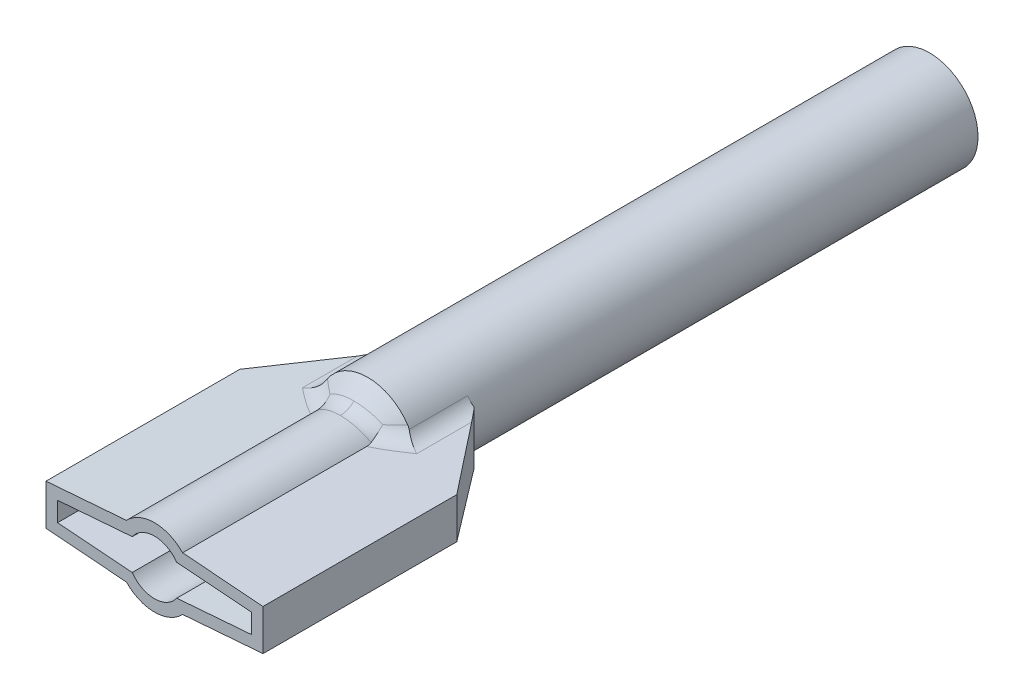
ISO-10303-21;
HEADER;
FILE_DESCRIPTION(('STEP AP214'),'2;1');
FILE_NAME('part.step','',(''),(''),'','','');
FILE_SCHEMA(('AUTOMOTIVE_DESIGN { 1 0 10303 214 1 1 1 1 }'));
ENDSEC;
DATA;
#1=APPLICATION_CONTEXT('core data for automotive mechanical design processes');
#2=APPLICATION_PROTOCOL_DEFINITION('international standard','automotive_design',2000,#1);
#3=PRODUCT_CONTEXT('',#1,'mechanical');
#4=PRODUCT('Part','Part','',(#3));
#5=PRODUCT_RELATED_PRODUCT_CATEGORY('part','',(#4));
#6=PRODUCT_DEFINITION_FORMATION('','',#4);
#7=PRODUCT_DEFINITION_CONTEXT('part definition',#1,'design');
#8=PRODUCT_DEFINITION('design','',#6,#7);
#9=PRODUCT_DEFINITION_SHAPE('','',#8);
#10=(LENGTH_UNIT() NAMED_UNIT(*) SI_UNIT(.MILLI.,.METRE.));
#11=(NAMED_UNIT(*) PLANE_ANGLE_UNIT() SI_UNIT($,.RADIAN.));
#12=(NAMED_UNIT(*) SI_UNIT($,.STERADIAN.) SOLID_ANGLE_UNIT());
#13=UNCERTAINTY_MEASURE_WITH_UNIT(LENGTH_MEASURE(1.E-05),#10,'distance_accuracy_value','');
#14=(GEOMETRIC_REPRESENTATION_CONTEXT(3) GLOBAL_UNCERTAINTY_ASSIGNED_CONTEXT((#13)) GLOBAL_UNIT_ASSIGNED_CONTEXT((#10,
#11,#12)) REPRESENTATION_CONTEXT('',''));
#15=CARTESIAN_POINT('',(0.,0.,0.));
#16=DIRECTION('',(0.,0.,1.));
#17=DIRECTION('',(1.,0.,0.));
#18=AXIS2_PLACEMENT_3D('',#15,#16,#17);
#19=CARTESIAN_POINT('',(2.8,1.5,-5.));
#20=DIRECTION('',(-0.790415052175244,0.,0.612571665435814));
#21=DIRECTION('',(0.612571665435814,0.,0.790415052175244));
#22=AXIS2_PLACEMENT_3D('',#19,#20,#21);
#23=PLANE('',#22);
#24=DIRECTION('',(0.611875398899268,0.0476651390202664,0.789516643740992));
#25=VECTOR('',#24,1.);
#26=CARTESIAN_POINT('',(2.8591334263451,-0.522932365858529,-4.923698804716));
#27=LINE('',#26,#25);
#28=CARTESIAN_POINT('',(1.25,-0.648283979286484,-7.));
#29=VERTEX_POINT('',#28);
#30=CARTESIAN_POINT('',(2.8,-0.527538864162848,-5.));
#31=VERTEX_POINT('',#30);
#32=EDGE_CURVE('E228',#29,#31,#27,.T.);
#33=ORIENTED_EDGE('',*,*,#32,.F.);
#34=DIRECTION('',(0.,-1.,0.));
#35=VECTOR('',#34,1.);
#36=CARTESIAN_POINT('',(1.25,1.5,-7.));
#37=LINE('',#36,#35);
#38=CARTESIAN_POINT('',(1.25,0.25,-7.));
#39=VERTEX_POINT('',#38);
#40=EDGE_CURVE('E363',#39,#29,#37,.T.);
#41=ORIENTED_EDGE('',*,*,#40,.F.);
#42=CARTESIAN_POINT('',(1.25,0.704095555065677,-7.));
#43=VERTEX_POINT('',#42);
#44=EDGE_CURVE('E57',#43,#39,#37,.T.);
#45=ORIENTED_EDGE('',*,*,#44,.F.);
#46=CARTESIAN_POINT('',(1.51304951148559,1.12930721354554,-6.66058127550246));
#47=DIRECTION('',(-0.790415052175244,0.,0.612571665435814));
#48=DIRECTION('',(0.612571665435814,0.,0.790415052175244));
#49=AXIS2_PLACEMENT_3D('',#46,#47,#48);
#50=ELLIPSE('',#49,0.816231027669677,0.5);
#51=CARTESIAN_POINT('',(1.47421712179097,0.630817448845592,-6.71068758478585));
#52=VERTEX_POINT('',#51);
#53=EDGE_CURVE('E674',#43,#52,#50,.T.);
#54=ORIENTED_EDGE('',*,*,#53,.T.);
#55=DIRECTION('',(-0.611875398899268,0.0476651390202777,-0.789516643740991));
#56=VECTOR('',#55,1.);
#57=CARTESIAN_POINT('',(2.77163804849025,0.529748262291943,-5.03659606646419));
#58=LINE('',#57,#56);
#59=CARTESIAN_POINT('',(2.8,0.527538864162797,-5.));
#60=VERTEX_POINT('',#59);
#61=EDGE_CURVE('E238',#60,#52,#58,.T.);
#62=ORIENTED_EDGE('',*,*,#61,.F.);
#63=DIRECTION('',(0.,1.,0.));
#64=VECTOR('',#63,1.);
#65=CARTESIAN_POINT('',(2.8,-0.527538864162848,-5.));
#66=LINE('',#65,#64);
#67=EDGE_CURVE('E241',#31,#60,#66,.T.);
#68=ORIENTED_EDGE('',*,*,#67,.F.);
#69=EDGE_LOOP('',(#33,#41,#45,#54,#62,#68));
#70=FACE_BOUND('',#69,.T.);
#71=ADVANCED_FACE('F29',(#70),#23,.F.);
#72=CARTESIAN_POINT('',(0.,0.25,-5.));
#73=DIRECTION('',(0.,0.,1.));
#74=DIRECTION('',(1.,0.,0.));
#75=AXIS2_PLACEMENT_3D('',#72,#73,#74);
#76=PLANE('',#75);
#77=CARTESIAN_POINT('',(0.,0.,-5.));
#78=DIRECTION('',(0.,0.,1.));
#79=DIRECTION('',(1.,0.,0.));
#80=AXIS2_PLACEMENT_3D('',#77,#78,#79);
#81=CIRCLE('',#80,1.);
#82=CARTESIAN_POINT('',(0.,-1.,-5.));
#83=VERTEX_POINT('',#82);
#84=CARTESIAN_POINT('',(0.72455582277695,-0.689216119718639,-5.));
#85=VERTEX_POINT('',#84);
#86=EDGE_CURVE('E445',#83,#85,#81,.T.);
#87=ORIENTED_EDGE('',*,*,#86,.F.);
#88=CARTESIAN_POINT('',(0.,0.25,-5.));
#89=DIRECTION('',(0.,0.,1.));
#90=DIRECTION('',(-1.,0.,0.));
#91=AXIS2_PLACEMENT_3D('',#88,#89,#90);
#92=CIRCLE('',#91,1.25);
#93=CARTESIAN_POINT('',(0.834498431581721,-0.680651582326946,-5.));
#94=VERTEX_POINT('',#93);
#95=EDGE_CURVE('E344',#83,#94,#92,.T.);
#96=ORIENTED_EDGE('',*,*,#95,.T.);
#97=DIRECTION('',(0.996979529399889,0.0776647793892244,0.));
#98=VECTOR('',#97,1.);
#99=CARTESIAN_POINT('',(0.72455582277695,-0.689216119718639,-5.));
#100=LINE('',#99,#98);
#101=EDGE_CURVE('E246',#85,#94,#100,.T.);
#102=ORIENTED_EDGE('',*,*,#101,.F.);
#103=EDGE_LOOP('',(#87,#96,#102));
#104=FACE_BOUND('',#103,.T.);
#105=ADVANCED_FACE('F482',(#104),#76,.T.);
#106=CARTESIAN_POINT('',(1.25,1.5,-7.));
#107=DIRECTION('',(0.,0.,1.));
#108=DIRECTION('',(1.,0.,0.));
#109=AXIS2_PLACEMENT_3D('',#106,#107,#108);
#110=PLANE('',#109);
#111=DIRECTION('',(-0.996979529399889,-0.0776647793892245,0.));
#112=VECTOR('',#111,1.);
#113=CARTESIAN_POINT('',(2.8,-0.527538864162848,-7.));
#114=LINE('',#113,#112);
#115=CARTESIAN_POINT('',(0.834498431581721,-0.680651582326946,-7.));
#116=VERTEX_POINT('',#115);
#117=EDGE_CURVE('E236',#29,#116,#114,.T.);
#118=ORIENTED_EDGE('',*,*,#117,.T.);
#119=CARTESIAN_POINT('',(0.,0.25,-7.));
#120=DIRECTION('',(0.,0.,1.));
#121=DIRECTION('',(1.,0.,0.));
#122=AXIS2_PLACEMENT_3D('',#119,#120,#121);
#123=CIRCLE('',#122,1.25);
#124=EDGE_CURVE('E270',#39,#116,#123,.F.);
#125=ORIENTED_EDGE('',*,*,#124,.F.);
#126=ORIENTED_EDGE('',*,*,#40,.T.);
#127=EDGE_LOOP('',(#118,#125,#126));
#128=FACE_BOUND('',#127,.T.);
#129=ADVANCED_FACE('F510',(#128),#110,.F.);
#130=CARTESIAN_POINT('',(1.08074965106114,0.878076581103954,-7.));
#131=VERTEX_POINT('',#130);
#132=EDGE_CURVE('E265',#131,#39,#123,.F.);
#133=ORIENTED_EDGE('',*,*,#132,.F.);
#134=CARTESIAN_POINT('',(1.51304951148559,1.12930721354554,-7.));
#135=DIRECTION('',(0.,0.,1.));
#136=DIRECTION('',(1.,0.,0.));
#137=AXIS2_PLACEMENT_3D('',#134,#135,#136);
#138=CIRCLE('',#137,0.5);
#139=EDGE_CURVE('E672',#131,#43,#138,.T.);
#140=ORIENTED_EDGE('',*,*,#139,.T.);
#141=ORIENTED_EDGE('',*,*,#44,.T.);
#142=EDGE_LOOP('',(#133,#140,#141));
#143=FACE_BOUND('',#142,.T.);
#144=ADVANCED_FACE('F516',(#143),#110,.F.);
#145=CARTESIAN_POINT('',(0.,0.,-5.));
#146=DIRECTION('',(0.,0.,1.));
#147=DIRECTION('',(1.,0.,0.));
#148=AXIS2_PLACEMENT_3D('',#145,#146,#147);
#149=CYLINDRICAL_SURFACE('',#148,1.);
#150=CARTESIAN_POINT('',(0.,0.,0.));
#151=DIRECTION('',(0.,0.,1.));
#152=DIRECTION('',(1.,0.,0.));
#153=AXIS2_PLACEMENT_3D('',#150,#151,#152);
#154=CIRCLE('',#153,1.);
#155=CARTESIAN_POINT('',(-0.72455582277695,-0.689216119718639,0.));
#156=VERTEX_POINT('',#155);
#157=CARTESIAN_POINT('',(0.72455582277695,-0.689216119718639,0.));
#158=VERTEX_POINT('',#157);
#159=EDGE_CURVE('E410',#156,#158,#154,.T.);
#160=ORIENTED_EDGE('',*,*,#159,.F.);
#161=DIRECTION('',(0.,0.,1.));
#162=VECTOR('',#161,1.);
#163=CARTESIAN_POINT('',(-0.72455582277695,-0.689216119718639,-5.));
#164=LINE('',#163,#162);
#165=CARTESIAN_POINT('',(-0.72455582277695,-0.689216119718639,-5.));
#166=VERTEX_POINT('',#165);
#167=EDGE_CURVE('E264',#166,#156,#164,.T.);
#168=ORIENTED_EDGE('',*,*,#167,.F.);
#169=EDGE_CURVE('E446',#166,#83,#81,.T.);
#170=ORIENTED_EDGE('',*,*,#169,.T.);
#171=ORIENTED_EDGE('',*,*,#86,.T.);
#172=DIRECTION('',(0.,0.,1.));
#173=VECTOR('',#172,1.);
#174=CARTESIAN_POINT('',(0.72455582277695,-0.689216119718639,-5.));
#175=LINE('',#174,#173);
#176=EDGE_CURVE('E253',#85,#158,#175,.T.);
#177=ORIENTED_EDGE('',*,*,#176,.T.);
#178=EDGE_LOOP('',(#160,#168,#170,#171,#177));
#179=FACE_BOUND('',#178,.T.);
#180=ADVANCED_FACE('F477',(#179),#149,.T.);
#181=CARTESIAN_POINT('',(-0.72455582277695,-0.689216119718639,-5.));
#182=DIRECTION('',(-0.0776647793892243,-0.996979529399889,0.));
#183=DIRECTION('',(0.996979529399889,-0.0776647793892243,0.));
#184=AXIS2_PLACEMENT_3D('',#181,#182,#183);
#185=PLANE('',#184);
#186=DIRECTION('',(0.996979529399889,-0.0776647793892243,0.));
#187=VECTOR('',#186,1.);
#188=CARTESIAN_POINT('',(-0.72455582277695,-0.689216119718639,0.));
#189=LINE('',#188,#187);
#190=CARTESIAN_POINT('',(-2.8,-0.527538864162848,0.));
#191=VERTEX_POINT('',#190);
#192=EDGE_CURVE('E442',#191,#156,#189,.T.);
#193=ORIENTED_EDGE('',*,*,#192,.F.);
#194=DIRECTION('',(0.,0.,1.));
#195=VECTOR('',#194,1.);
#196=CARTESIAN_POINT('',(-2.8,-0.527538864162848,-5.));
#197=LINE('',#196,#195);
#198=CARTESIAN_POINT('',(-2.8,-0.527538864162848,-5.));
#199=VERTEX_POINT('',#198);
#200=EDGE_CURVE('E455',#199,#191,#197,.T.);
#201=ORIENTED_EDGE('',*,*,#200,.F.);
#202=DIRECTION('',(-0.611875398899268,0.0476651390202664,0.789516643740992));
#203=VECTOR('',#202,1.);
#204=CARTESIAN_POINT('',(-1.31265497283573,-0.643403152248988,-6.91915487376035));
#205=LINE('',#204,#203);
#206=CARTESIAN_POINT('',(-1.25,-0.648283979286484,-7.));
#207=VERTEX_POINT('',#206);
#208=EDGE_CURVE('E355',#207,#199,#205,.T.);
#209=ORIENTED_EDGE('',*,*,#208,.F.);
#210=DIRECTION('',(0.996979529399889,-0.0776647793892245,0.));
#211=VECTOR('',#210,1.);
#212=CARTESIAN_POINT('',(-2.8,-0.527538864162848,-7.));
#213=LINE('',#212,#211);
#214=CARTESIAN_POINT('',(-0.834498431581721,-0.680651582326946,-7.));
#215=VERTEX_POINT('',#214);
#216=EDGE_CURVE('E352',#207,#215,#213,.T.);
#217=ORIENTED_EDGE('',*,*,#216,.T.);
#218=DIRECTION('',(0.,0.,1.));
#219=VECTOR('',#218,1.);
#220=CARTESIAN_POINT('',(-0.834498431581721,-0.680651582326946,-9.96406488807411));
#221=LINE('',#220,#219);
#222=CARTESIAN_POINT('',(-0.834498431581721,-0.680651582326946,-5.));
#223=VERTEX_POINT('',#222);
#224=EDGE_CURVE('E356',#215,#223,#221,.T.);
#225=ORIENTED_EDGE('',*,*,#224,.T.);
#226=DIRECTION('',(0.996979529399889,-0.0776647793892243,0.));
#227=VECTOR('',#226,1.);
#228=CARTESIAN_POINT('',(-0.72455582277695,-0.689216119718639,-5.));
#229=LINE('',#228,#227);
#230=EDGE_CURVE('E257',#223,#166,#229,.T.);
#231=ORIENTED_EDGE('',*,*,#230,.T.);
#232=ORIENTED_EDGE('',*,*,#167,.T.);
#233=EDGE_LOOP('',(#193,#201,#209,#217,#225,#231,#232));
#234=FACE_BOUND('',#233,.T.);
#235=ADVANCED_FACE('F493',(#234),#185,.T.);
#236=CARTESIAN_POINT('',(-2.8,-0.527538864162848,-5.));
#237=DIRECTION('',(-1.,0.,0.));
#238=DIRECTION('',(0.,0.,1.));
#239=AXIS2_PLACEMENT_3D('',#236,#237,#238);
#240=PLANE('',#239);
#241=DIRECTION('',(0.,-1.,0.));
#242=VECTOR('',#241,1.);
#243=CARTESIAN_POINT('',(-2.8,-0.527538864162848,0.));
#244=LINE('',#243,#242);
#245=CARTESIAN_POINT('',(-2.8,0.527538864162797,0.));
#246=VERTEX_POINT('',#245);
#247=EDGE_CURVE('E439',#246,#191,#244,.T.);
#248=ORIENTED_EDGE('',*,*,#247,.F.);
#249=DIRECTION('',(0.,0.,1.));
#250=VECTOR('',#249,1.);
#251=CARTESIAN_POINT('',(-2.8,0.527538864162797,-5.));
#252=LINE('',#251,#250);
#253=CARTESIAN_POINT('',(-2.8,0.527538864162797,-5.));
#254=VERTEX_POINT('',#253);
#255=EDGE_CURVE('E457',#254,#246,#252,.T.);
#256=ORIENTED_EDGE('',*,*,#255,.F.);
#257=DIRECTION('',(0.,-1.,0.));
#258=VECTOR('',#257,1.);
#259=CARTESIAN_POINT('',(-2.8,-0.527538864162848,-5.));
#260=LINE('',#259,#258);
#261=EDGE_CURVE('E245',#254,#199,#260,.T.);
#262=ORIENTED_EDGE('',*,*,#261,.T.);
#263=ORIENTED_EDGE('',*,*,#200,.T.);
#264=EDGE_LOOP('',(#248,#256,#262,#263));
#265=FACE_BOUND('',#264,.T.);
#266=ADVANCED_FACE('F690',(#265),#240,.T.);
#267=CARTESIAN_POINT('',(-2.8,0.527538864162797,-5.));
#268=DIRECTION('',(-0.0776647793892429,0.996979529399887,0.));
#269=DIRECTION('',(-0.996979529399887,-0.0776647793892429,0.));
#270=AXIS2_PLACEMENT_3D('',#267,#268,#269);
#271=PLANE('',#270);
#272=CARTESIAN_POINT('',(-7.23695986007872,0.637030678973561,-11.4973016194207));
#273=CARTESIAN_POINT('',(-7.23130301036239,0.182340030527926,-11.4673708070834));
#274=CARTESIAN_POINT('',(-7.55117634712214,0.157421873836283,-11.1437482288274));
#275=CARTESIAN_POINT('',(-6.97358477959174,0.655936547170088,-11.235327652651));
#276=CARTESIAN_POINT('',(-6.96927489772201,0.202752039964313,-11.2047506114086));
#277=CARTESIAN_POINT('',(-7.28771175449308,0.17794578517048,-10.8817742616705));
#278=CARTESIAN_POINT('',(-6.71012257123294,0.674707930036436,-10.97345470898));
#279=CARTESIAN_POINT('',(-6.7070912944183,0.223176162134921,-10.9419967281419));
#280=CARTESIAN_POINT('',(-7.0241470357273,0.198477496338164,-10.6199013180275));
#281=CARTESIAN_POINT('',(-6.1828595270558,0.711815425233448,-10.4499701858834));
#282=CARTESIAN_POINT('',(-6.18238934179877,0.264050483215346,-10.4162539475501));
#283=CARTESIAN_POINT('',(-6.49661138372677,0.239572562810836,-10.0964167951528));
#284=CARTESIAN_POINT('',(-5.91905861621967,0.730151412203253,-10.1883587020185));
#285=CARTESIAN_POINT('',(-5.92008427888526,0.284484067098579,-10.1534784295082));
#286=CARTESIAN_POINT('',(-6.23264035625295,0.260135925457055,-9.83480531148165));
#287=CARTESIAN_POINT('',(-5.3896360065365,0.766311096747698,-9.6641525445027));
#288=CARTESIAN_POINT('',(-5.39379373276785,0.325482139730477,-9.62639887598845));
#289=CARTESIAN_POINT('',(-5.70276709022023,0.301413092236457,-9.31059915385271));
#290=CARTESIAN_POINT('',(-5.12401233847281,0.784131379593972,-9.40156049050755));
#291=CARTESIAN_POINT('',(-5.13009643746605,0.346024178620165,-9.36238361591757));
#292=CARTESIAN_POINT('',(-5.43686227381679,0.322127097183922,-9.04800709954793));
#293=CARTESIAN_POINT('',(-4.59232906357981,0.818825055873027,-8.87718192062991));
#294=CARTESIAN_POINT('',(-4.60238931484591,0.38713260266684,-8.83431905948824));
#295=CARTESIAN_POINT('',(-4.9044088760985,0.363605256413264,-8.52362852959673));
#296=CARTESIAN_POINT('',(-4.32626959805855,0.835698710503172,-8.61539520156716));
#297=CARTESIAN_POINT('',(-4.33882153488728,0.407664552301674,-8.57071039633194));
#298=CARTESIAN_POINT('',(-4.63786049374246,0.384369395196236,-8.26184181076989));
#299=CARTESIAN_POINT('',(-3.80066195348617,0.867510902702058,-8.10012244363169));
#300=CARTESIAN_POINT('',(-3.81828005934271,0.448214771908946,-8.05059939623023));
#301=CARTESIAN_POINT('',(-4.1108884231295,0.425420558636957,-7.7465690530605));
#302=CARTESIAN_POINT('',(-3.54113388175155,0.882489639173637,-7.8466045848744));
#303=CARTESIAN_POINT('',(-3.56201402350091,0.468177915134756,-7.79478640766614));
#304=CARTESIAN_POINT('',(-3.85049573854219,0.445705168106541,-7.49305119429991));
#305=CARTESIAN_POINT('',(-3.15092608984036,0.903110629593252,-7.46774631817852));
#306=CARTESIAN_POINT('',(-3.17571880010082,0.498270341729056,-7.40998694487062));
#307=CARTESIAN_POINT('',(-3.45832961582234,0.476254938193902,-7.11419292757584));
#308=CARTESIAN_POINT('',(-3.02064883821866,0.909678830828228,-7.34164353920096));
#309=CARTESIAN_POINT('',(-3.04730908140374,0.508273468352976,-7.28220737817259));
#310=CARTESIAN_POINT('',(-3.3272888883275,0.486463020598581,-6.988090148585));
#311=CARTESIAN_POINT('',(-2.75976952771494,0.921957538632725,-7.09017674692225));
#312=CARTESIAN_POINT('',(-2.79029079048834,0.52829521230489,-7.02688089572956));
#313=CARTESIAN_POINT('',(-3.06452350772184,0.506932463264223,-6.73662335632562));
#314=CARTESIAN_POINT('',(-2.6291674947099,0.927668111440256,-6.96481267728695));
#315=CARTESIAN_POINT('',(-2.66186096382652,0.538299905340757,-6.89950868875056));
#316=CARTESIAN_POINT('',(-2.93279890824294,0.517193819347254,-6.61125928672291));
#317=CARTESIAN_POINT('',(-2.36792938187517,0.937875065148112,-6.71550443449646));
#318=CARTESIAN_POINT('',(-2.40507989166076,0.558303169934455,-6.64553492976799));
#319=CARTESIAN_POINT('',(-2.66873063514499,0.537764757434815,-6.36195104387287));
#320=CARTESIAN_POINT('',(-2.23729447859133,0.942374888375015,-6.59155721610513));
#321=CARTESIAN_POINT('',(-2.27697350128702,0.568282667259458,-6.51916799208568));
#322=CARTESIAN_POINT('',(-2.5363898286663,0.548074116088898,-6.23800382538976));
#323=CARTESIAN_POINT('',(-1.97551079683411,0.949643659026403,-6.34527092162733));
#324=CARTESIAN_POINT('',(-2.02027610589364,0.588279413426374,-6.26717196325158));
#325=CARTESIAN_POINT('',(-2.27015444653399,0.568813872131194,-5.99171753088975));
#326=CARTESIAN_POINT('',(-1.84436187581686,0.952412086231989,-6.22293233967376));
#327=CARTESIAN_POINT('',(-1.89202173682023,0.598270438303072,-6.14186136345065));
#328=CARTESIAN_POINT('',(-2.13625941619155,0.5792443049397,-5.8693789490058));
#329=CARTESIAN_POINT('',(-1.58175420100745,0.955348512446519,-5.98112778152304));
#330=CARTESIAN_POINT('',(-1.63498163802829,0.618293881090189,-5.8929448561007));
#331=CARTESIAN_POINT('',(-1.86623899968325,0.600278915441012,-5.62757439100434));
#332=CARTESIAN_POINT('',(-1.45029619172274,0.955520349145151,-5.86165782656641));
#333=CARTESIAN_POINT('',(-1.50668162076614,0.62828846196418,-5.76977713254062));
#334=CARTESIAN_POINT('',(-1.73011720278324,0.610882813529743,-5.50810443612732));
#335=CARTESIAN_POINT('',(-1.2530013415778,0.952788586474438,-5.68632593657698));
#336=CARTESIAN_POINT('',(-1.31237632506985,0.643424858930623,-5.58693734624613));
#337=CARTESIAN_POINT('',(-1.52272794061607,0.627038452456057,-5.33277254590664));
#338=CARTESIAN_POINT('',(-1.18723439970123,0.951380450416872,-5.62854104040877));
#339=CARTESIAN_POINT('',(-1.24787061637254,0.648449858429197,-5.52683180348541));
#340=CARTESIAN_POINT('',(-1.45308105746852,0.632463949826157,-5.27498764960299));
#341=CARTESIAN_POINT('',(-1.05578449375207,0.947339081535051,-5.51485641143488));
#342=CARTESIAN_POINT('',(-1.11844447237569,0.658532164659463,-5.40814790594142));
#343=CARTESIAN_POINT('',(-1.31227888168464,0.643432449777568,-5.16130302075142));
#344=CARTESIAN_POINT('',(-0.990101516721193,0.944706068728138,-5.45895634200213));
#345=CARTESIAN_POINT('',(-1.05362857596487,0.663581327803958,-5.34964614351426));
#346=CARTESIAN_POINT('',(-1.24112386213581,0.648975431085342,-5.10540295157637));
#347=CARTESIAN_POINT('',(-0.897743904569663,0.939997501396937,-5.38217420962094));
#348=CARTESIAN_POINT('',(-0.961504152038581,0.670757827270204,-5.26868494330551));
#349=CARTESIAN_POINT('',(-1.13931063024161,0.656906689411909,-5.02862081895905));
#350=CARTESIAN_POINT('',(-0.870933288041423,0.938510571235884,-5.36010215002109));
#351=CARTESIAN_POINT('',(-0.934785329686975,0.67283922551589,-5.24545810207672));
#352=CARTESIAN_POINT('',(-1.10954495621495,0.659225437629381,-5.00654875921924));
#353=CARTESIAN_POINT('',(-0.817394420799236,0.935295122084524,-5.31654493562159));
#354=CARTESIAN_POINT('',(-0.881226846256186,0.677011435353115,-5.1995476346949));
#355=CARTESIAN_POINT('',(-1.04958905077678,0.663896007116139,-4.96299154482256));
#356=CARTESIAN_POINT('',(-0.79066617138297,0.93356659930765,-5.29505979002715));
#357=CARTESIAN_POINT('',(-0.85439519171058,0.679101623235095,-5.1768676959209));
#358=CARTESIAN_POINT('',(-1.01939881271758,0.66624782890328,-4.94150639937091));
#359=CARTESIAN_POINT('',(-0.710757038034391,0.928025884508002,-5.23174458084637));
#360=CARTESIAN_POINT('',(-0.773994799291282,0.685364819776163,-5.11008655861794));
#361=CARTESIAN_POINT('',(-0.928212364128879,0.673351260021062,-4.87819119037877));
#362=CARTESIAN_POINT('',(-0.657744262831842,0.923853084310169,-5.19096465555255));
#363=CARTESIAN_POINT('',(-0.720046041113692,0.689567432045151,-5.06681916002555));
#364=CARTESIAN_POINT('',(-0.866482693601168,0.678160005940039,-4.83741126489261));
#365=CARTESIAN_POINT('',(-0.552365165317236,0.914746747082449,-5.11353369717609));
#366=CARTESIAN_POINT('',(-0.611054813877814,0.698057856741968,-4.98436490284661));
#367=CARTESIAN_POINT('',(-0.740152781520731,0.688001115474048,-4.75998030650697));
#368=CARTESIAN_POINT('',(-0.500001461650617,0.909810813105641,-5.07689632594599));
#369=CARTESIAN_POINT('',(-0.556054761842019,0.702342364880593,-4.94517183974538));
#370=CARTESIAN_POINT('',(-0.67554396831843,0.693034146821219,-4.72334293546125));
#371=CARTESIAN_POINT('',(-0.422339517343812,0.902497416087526,-5.02699575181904));
#372=CARTESIAN_POINT('',(-0.472231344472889,0.708872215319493,-4.89150404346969));
#373=CARTESIAN_POINT('',(-0.575840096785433,0.700801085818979,-4.67344236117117));
#374=CARTESIAN_POINT('',(-0.396522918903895,0.900067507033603,-5.01116475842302));
#375=CARTESIAN_POINT('',(-0.444094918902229,0.711064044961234,-4.87448010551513));
#376=CARTESIAN_POINT('',(-0.542034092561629,0.703434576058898,-4.65761136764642));
#377=CARTESIAN_POINT('',(-0.345254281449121,0.895483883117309,-4.98171394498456));
#378=CARTESIAN_POINT('',(-0.387436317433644,0.71547775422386,-4.8427803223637));
#379=CARTESIAN_POINT('',(-0.473423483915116,0.708779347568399,-4.62816055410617));
#380=CARTESIAN_POINT('',(-0.319802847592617,0.893330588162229,-4.96809747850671));
#381=CARTESIAN_POINT('',(-0.35890336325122,0.717700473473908,-4.82808894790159));
#382=CARTESIAN_POINT('',(-0.438617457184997,0.711490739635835,-4.61454408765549));
#383=CARTESIAN_POINT('',(-0.294579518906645,0.891440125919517,-4.9558487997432));
#384=CARTESIAN_POINT('',(-0.330092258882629,0.719944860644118,-4.81482338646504));
#385=CARTESIAN_POINT('',(-0.40329939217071,0.714242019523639,-4.60229540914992));
#386=(BOUNDED_SURFACE() B_SPLINE_SURFACE(3,2,((#272,#273,#274),(#275,#276,#277),(#278,#279,
#280),(#281,#282,#283),(#284,#285,#286),(#287,#288,#289),(#290,#291,#292),(#293,#294,#295),
(#296,#297,#298),(#299,#300,#301),(#302,#303,#304),(#305,#306,#307),(#308,#309,#310),(#311,#312,
#313),(#314,#315,#316),(#317,#318,#319),(#320,#321,#322),(#323,#324,#325),(#326,#327,#328),
(#329,#330,#331),(#332,#333,#334),(#335,#336,#337),(#338,#339,#340),(#341,#342,#343),(#344,#345,
#346),(#347,#348,#349),(#350,#351,#352),(#353,#354,#355),(#356,#357,#358),(#359,#360,#361),
(#362,#363,#364),(#365,#366,#367),(#368,#369,#370),(#371,#372,#373),(#374,#375,#376),(#377,#378,
#379),(#380,#381,#382),(#383,#384,#385)),.UNSPECIFIED.,.F.,.F.,
.F.) B_SPLINE_SURFACE_WITH_KNOTS((4,2,2,2,2,2,2,2,2,2,2,2,2,2,2,2,2,2,4),(3,3),(0.,
1.11632755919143,2.23297273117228,3.35582577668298,4.47836746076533,5.57032352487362,
6.11676464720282,6.66316354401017,7.2079921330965,7.75298434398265,8.2971709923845,
8.56913228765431,8.84104475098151,8.95242512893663,9.0638072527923,9.2861263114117,
9.50915840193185,9.62135362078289,9.73371719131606),(0.,1.),
.UNSPECIFIED.) GEOMETRIC_REPRESENTATION_ITEM() RATIONAL_B_SPLINE_SURFACE(((1.,0.739082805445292,
1.),(1.,0.740168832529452,1.),(1.,0.741348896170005,1.),(1.,0.744011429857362,1.),(1.,
0.74549398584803,1.),(1.,0.748884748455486,1.),(1.,0.750795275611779,1.),(1.,0.755246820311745,
1.),(1.,0.75778766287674,1.),(1.,0.763772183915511,1.),(1.,0.76718937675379,1.),(1.,
0.773506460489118,1.),(1.,0.775811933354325,1.),(1.,0.780963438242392,1.),(1.,0.783809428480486,
1.),(1.,0.790234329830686,1.),(1.,0.79381111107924,1.),(1.,0.802010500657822,1.),(1.,
0.806633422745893,1.),(1.,0.817390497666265,1.),(1.,0.823522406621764,1.),(1.,0.834382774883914,
1.),(1.,0.838278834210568,1.),(1.,0.846728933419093,1.),(1.,0.85128285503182,1.),(1.,
0.858212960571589,1.),(1.,0.860287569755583,1.),(1.,0.864556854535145,1.),(1.,0.866751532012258,
1.),(1.,0.873500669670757,1.),(1.,0.878228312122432,1.),(1.,0.888001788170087,1.),(1.,
0.89304859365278,1.),(1.,0.900466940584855,1.),(1.,0.902921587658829,1.),(1.,0.907645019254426,
1.),(1.,0.909913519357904,1.),(1.,0.912020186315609,1.))) REPRESENTATION_ITEM('') SURFACE());
#387=CARTESIAN_POINT('',(-0.40329939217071,0.714242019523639,-4.60229540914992));
#388=CARTESIAN_POINT('',(-0.438617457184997,0.711490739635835,-4.61454408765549));
#389=CARTESIAN_POINT('',(-0.473423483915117,0.708779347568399,-4.62816055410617));
#390=CARTESIAN_POINT('',(-0.542034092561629,0.703434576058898,-4.65761136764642));
#391=CARTESIAN_POINT('',(-0.575840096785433,0.700801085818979,-4.67344236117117));
#392=CARTESIAN_POINT('',(-0.67554396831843,0.693034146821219,-4.72334293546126));
#393=CARTESIAN_POINT('',(-0.740152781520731,0.688001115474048,-4.75998030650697));
#394=CARTESIAN_POINT('',(-0.866482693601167,0.678160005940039,-4.83741126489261));
#395=CARTESIAN_POINT('',(-0.928212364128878,0.673351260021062,-4.87819119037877));
#396=CARTESIAN_POINT('',(-1.01939881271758,0.66624782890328,-4.94150639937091));
#397=CARTESIAN_POINT('',(-1.04958905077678,0.663896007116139,-4.96299154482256));
#398=CARTESIAN_POINT('',(-1.10954495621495,0.659225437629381,-5.00654875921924));
#399=CARTESIAN_POINT('',(-1.13931063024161,0.656906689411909,-5.02862081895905));
#400=CARTESIAN_POINT('',(-1.24112386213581,0.648975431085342,-5.10540295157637));
#401=CARTESIAN_POINT('',(-1.31227888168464,0.643432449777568,-5.16130302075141));
#402=CARTESIAN_POINT('',(-1.45308105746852,0.632463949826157,-5.27498764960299));
#403=CARTESIAN_POINT('',(-1.52272794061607,0.627038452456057,-5.33277254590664));
#404=CARTESIAN_POINT('',(-1.73011720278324,0.610882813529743,-5.50810443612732));
#405=CARTESIAN_POINT('',(-1.86623899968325,0.600278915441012,-5.62757439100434));
#406=CARTESIAN_POINT('',(-2.13625941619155,0.5792443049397,-5.8693789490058));
#407=CARTESIAN_POINT('',(-2.27015444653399,0.568813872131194,-5.99171753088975));
#408=CARTESIAN_POINT('',(-2.5363898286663,0.548074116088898,-6.23800382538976));
#409=CARTESIAN_POINT('',(-2.66873063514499,0.537764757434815,-6.36195104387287));
#410=CARTESIAN_POINT('',(-2.93279890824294,0.517193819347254,-6.61125928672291));
#411=CARTESIAN_POINT('',(-3.06452350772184,0.506932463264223,-6.73662335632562));
#412=CARTESIAN_POINT('',(-3.3272888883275,0.486463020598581,-6.988090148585));
#413=CARTESIAN_POINT('',(-3.45832961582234,0.476254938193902,-7.11419292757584));
#414=CARTESIAN_POINT('',(-3.85049573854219,0.445705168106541,-7.49305119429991));
#415=CARTESIAN_POINT('',(-4.1108884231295,0.425420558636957,-7.7465690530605));
#416=CARTESIAN_POINT('',(-4.63786049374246,0.384369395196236,-8.26184181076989));
#417=CARTESIAN_POINT('',(-4.9044088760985,0.363605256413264,-8.52362852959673));
#418=CARTESIAN_POINT('',(-5.43686227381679,0.322127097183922,-9.04800709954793));
#419=CARTESIAN_POINT('',(-5.70276709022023,0.301413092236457,-9.31059915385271));
#420=CARTESIAN_POINT('',(-6.23264035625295,0.260135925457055,-9.83480531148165));
#421=CARTESIAN_POINT('',(-6.49661138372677,0.239572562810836,-10.0964167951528));
#422=CARTESIAN_POINT('',(-7.0241470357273,0.198477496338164,-10.6199013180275));
#423=CARTESIAN_POINT('',(-7.28771175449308,0.17794578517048,-10.8817742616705));
#424=CARTESIAN_POINT('',(-7.55117634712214,0.157421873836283,-11.1437482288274));
#425=B_SPLINE_CURVE_WITH_KNOTS('',3,(#387,#388,#389,#390,#391,#392,#393,#394,#395,#396,#397,
#398,#399,#400,#401,#402,#403,#404,#405,#406,#407,#408,#409,#410,#411,#412,#413,#414,#415,#416,
#417,#418,#419,#420,#421,#422,#423,#424),.UNSPECIFIED.,.F.,.F.,(4,2,2,2,2,2,2,2,2,2,2,2,2,2,2,2,
2,2,4),(0.,0.112363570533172,0.22455878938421,0.447590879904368,0.669909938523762,
0.781292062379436,0.892672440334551,1.16458490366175,1.43654619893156,1.98073284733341,
2.52572505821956,3.07055364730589,3.61695254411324,4.16339366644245,5.25534973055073,
6.37789141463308,7.50074446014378,8.61738963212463,9.73371719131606),.UNSPECIFIED.);
#426=CARTESIAN_POINT('',(-0.724555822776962,0.689216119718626,-4.75204742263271));
#427=VERTEX_POINT('',#426);
#428=CARTESIAN_POINT('',(-1.47421712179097,0.630817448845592,-5.29289321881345));
#429=VERTEX_POINT('',#428);
#430=EDGE_CURVE('E665',#427,#429,#425,.T.);
#431=ORIENTED_EDGE('',*,*,#430,.T.);
#432=DIRECTION('',(0.,0.,-1.));
#433=VECTOR('',#432,1.);
#434=CARTESIAN_POINT('',(-1.47421712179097,0.630817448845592,-7.));
#435=LINE('',#434,#433);
#436=CARTESIAN_POINT('',(-1.47421712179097,0.630817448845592,-6.71068758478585));
#437=VERTEX_POINT('',#436);
#438=EDGE_CURVE('E670',#429,#437,#435,.T.);
#439=ORIENTED_EDGE('',*,*,#438,.T.);
#440=DIRECTION('',(0.611875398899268,0.0476651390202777,-0.789516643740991));
#441=VECTOR('',#440,1.);
#442=CARTESIAN_POINT('',(-1.22515959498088,0.650219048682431,-7.03205213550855));
#443=LINE('',#442,#441);
#444=EDGE_CURVE('E266',#254,#437,#443,.T.);
#445=ORIENTED_EDGE('',*,*,#444,.F.);
#446=ORIENTED_EDGE('',*,*,#255,.T.);
#447=DIRECTION('',(-0.996979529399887,-0.0776647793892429,0.));
#448=VECTOR('',#447,1.);
#449=CARTESIAN_POINT('',(-2.8,0.527538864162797,0.));
#450=LINE('',#449,#448);
#451=CARTESIAN_POINT('',(-0.724555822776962,0.689216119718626,0.));
#452=VERTEX_POINT('',#451);
#453=EDGE_CURVE('E436',#452,#246,#450,.T.);
#454=ORIENTED_EDGE('',*,*,#453,.F.);
#455=DIRECTION('',(0.,0.,1.));
#456=VECTOR('',#455,1.);
#457=CARTESIAN_POINT('',(-0.724555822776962,0.689216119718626,-5.));
#458=LINE('',#457,#456);
#459=EDGE_CURVE('E459',#427,#452,#458,.T.);
#460=ORIENTED_EDGE('',*,*,#459,.F.);
#461=EDGE_LOOP('',(#431,#439,#445,#446,#454,#460));
#462=FACE_BOUND('',#461,.T.);
#463=ADVANCED_FACE('F306',(#462),#271,.T.);
#464=CARTESIAN_POINT('',(0.,0.,-5.));
#465=DIRECTION('',(0.,0.,1.));
#466=DIRECTION('',(1.,0.,0.));
#467=AXIS2_PLACEMENT_3D('',#464,#465,#466);
#468=CYLINDRICAL_SURFACE('',#467,1.);
#469=DIRECTION('',(0.,0.,1.));
#470=VECTOR('',#469,1.);
#471=CARTESIAN_POINT('',(0.724555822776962,0.689216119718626,-5.));
#472=LINE('',#471,#470);
#473=CARTESIAN_POINT('',(0.724555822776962,0.689216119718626,-4.75204742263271));
#474=VERTEX_POINT('',#473);
#475=CARTESIAN_POINT('',(0.724555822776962,0.689216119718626,0.));
#476=VERTEX_POINT('',#475);
#477=EDGE_CURVE('E255',#474,#476,#472,.T.);
#478=ORIENTED_EDGE('',*,*,#477,.F.);
#479=CARTESIAN_POINT('',(7.55117634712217,0.157421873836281,-11.1437482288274));
#480=CARTESIAN_POINT('',(7.23130301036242,0.182340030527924,-11.4673708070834));
#481=CARTESIAN_POINT('',(7.23695986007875,0.637030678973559,-11.4973016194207));
#482=CARTESIAN_POINT('',(7.2877117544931,0.177945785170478,-10.8817742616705));
#483=CARTESIAN_POINT('',(6.96927489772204,0.20275203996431,-11.2047506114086));
#484=CARTESIAN_POINT('',(6.97358477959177,0.655936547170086,-11.235327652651));
#485=CARTESIAN_POINT('',(7.02414703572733,0.198477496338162,-10.6199013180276));
#486=CARTESIAN_POINT('',(6.70709129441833,0.223176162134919,-10.9419967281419));
#487=CARTESIAN_POINT('',(6.71012257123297,0.674707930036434,-10.97345470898));
#488=CARTESIAN_POINT('',(6.49661138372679,0.239572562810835,-10.0964167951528));
#489=CARTESIAN_POINT('',(6.18238934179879,0.264050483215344,-10.4162539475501));
#490=CARTESIAN_POINT('',(6.18285952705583,0.711815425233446,-10.4499701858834));
#491=CARTESIAN_POINT('',(6.23264035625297,0.260135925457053,-9.83480531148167));
#492=CARTESIAN_POINT('',(5.92008427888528,0.284484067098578,-10.1534784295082));
#493=CARTESIAN_POINT('',(5.9190586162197,0.730151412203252,-10.1883587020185));
#494=CARTESIAN_POINT('',(5.70276709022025,0.301413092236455,-9.31059915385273));
#495=CARTESIAN_POINT('',(5.39379373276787,0.325482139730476,-9.62639887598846));
#496=CARTESIAN_POINT('',(5.38963600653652,0.766311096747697,-9.66415254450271));
#497=CARTESIAN_POINT('',(5.4368622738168,0.32212709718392,-9.04800709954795));
#498=CARTESIAN_POINT('',(5.13009643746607,0.346024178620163,-9.36238361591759));
#499=CARTESIAN_POINT('',(5.12401233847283,0.784131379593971,-9.40156049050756));
#500=CARTESIAN_POINT('',(4.90440887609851,0.363605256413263,-8.52362852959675));
#501=CARTESIAN_POINT('',(4.60238931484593,0.387132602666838,-8.83431905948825));
#502=CARTESIAN_POINT('',(4.59232906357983,0.818825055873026,-8.87718192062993));
#503=CARTESIAN_POINT('',(4.63786049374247,0.384369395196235,-8.2618418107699));
#504=CARTESIAN_POINT('',(4.3388215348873,0.407664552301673,-8.57071039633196));
#505=CARTESIAN_POINT('',(4.32626959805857,0.835698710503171,-8.61539520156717));
#506=CARTESIAN_POINT('',(4.11088842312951,0.425420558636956,-7.74656905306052));
#507=CARTESIAN_POINT('',(3.81828005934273,0.448214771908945,-8.05059939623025));
#508=CARTESIAN_POINT('',(3.80066195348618,0.867510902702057,-8.10012244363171));
#509=CARTESIAN_POINT('',(3.85049573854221,0.445705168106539,-7.49305119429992));
#510=CARTESIAN_POINT('',(3.56201402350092,0.468177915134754,-7.79478640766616));
#511=CARTESIAN_POINT('',(3.54113388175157,0.882489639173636,-7.84660458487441));
#512=CARTESIAN_POINT('',(3.45832961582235,0.476254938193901,-7.11419292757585));
#513=CARTESIAN_POINT('',(3.17571880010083,0.498270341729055,-7.40998694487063));
#514=CARTESIAN_POINT('',(3.15092608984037,0.903110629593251,-7.46774631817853));
#515=CARTESIAN_POINT('',(3.32728888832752,0.48646302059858,-6.98809014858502));
#516=CARTESIAN_POINT('',(3.04730908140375,0.508273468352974,-7.28220737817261));
#517=CARTESIAN_POINT('',(3.02064883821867,0.909678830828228,-7.34164353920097));
#518=CARTESIAN_POINT('',(3.06452350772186,0.506932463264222,-6.73662335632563));
#519=CARTESIAN_POINT('',(2.79029079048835,0.528295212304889,-7.02688089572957));
#520=CARTESIAN_POINT('',(2.75976952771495,0.921957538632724,-7.09017674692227));
#521=CARTESIAN_POINT('',(2.93279890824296,0.517193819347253,-6.61125928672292));
#522=CARTESIAN_POINT('',(2.66186096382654,0.538299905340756,-6.89950868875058));
#523=CARTESIAN_POINT('',(2.62916749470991,0.927668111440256,-6.96481267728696));
#524=CARTESIAN_POINT('',(2.668730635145,0.537764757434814,-6.36195104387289));
#525=CARTESIAN_POINT('',(2.40507989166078,0.558303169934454,-6.645534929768));
#526=CARTESIAN_POINT('',(2.36792938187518,0.937875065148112,-6.71550443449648));
#527=CARTESIAN_POINT('',(2.53638982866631,0.548074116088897,-6.23800382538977));
#528=CARTESIAN_POINT('',(2.27697350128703,0.568282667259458,-6.51916799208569));
#529=CARTESIAN_POINT('',(2.23729447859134,0.942374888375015,-6.59155721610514));
#530=CARTESIAN_POINT('',(2.270154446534,0.568813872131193,-5.99171753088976));
#531=CARTESIAN_POINT('',(2.02027610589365,0.588279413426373,-6.26717196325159));
#532=CARTESIAN_POINT('',(1.97551079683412,0.949643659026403,-6.34527092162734));
#533=CARTESIAN_POINT('',(2.13625941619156,0.579244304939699,-5.8693789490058));
#534=CARTESIAN_POINT('',(1.89202173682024,0.598270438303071,-6.14186136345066));
#535=CARTESIAN_POINT('',(1.84436187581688,0.952412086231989,-6.22293233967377));
#536=CARTESIAN_POINT('',(1.86623899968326,0.600278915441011,-5.62757439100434));
#537=CARTESIAN_POINT('',(1.6349816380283,0.618293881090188,-5.89294485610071));
#538=CARTESIAN_POINT('',(1.58175420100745,0.955348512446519,-5.98112778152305));
#539=CARTESIAN_POINT('',(1.73011720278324,0.610882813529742,-5.50810443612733));
#540=CARTESIAN_POINT('',(1.50668162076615,0.628288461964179,-5.76977713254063));
#541=CARTESIAN_POINT('',(1.45029619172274,0.95552034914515,-5.86165782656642));
#542=CARTESIAN_POINT('',(1.52272794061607,0.627038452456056,-5.33277254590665));
#543=CARTESIAN_POINT('',(1.31237632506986,0.643424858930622,-5.58693734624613));
#544=CARTESIAN_POINT('',(1.25300134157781,0.952788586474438,-5.68632593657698));
#545=CARTESIAN_POINT('',(1.45308105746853,0.632463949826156,-5.27498764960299));
#546=CARTESIAN_POINT('',(1.24787061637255,0.648449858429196,-5.52683180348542));
#547=CARTESIAN_POINT('',(1.18723439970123,0.951380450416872,-5.62854104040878));
#548=CARTESIAN_POINT('',(1.31227888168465,0.643432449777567,-5.16130302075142));
#549=CARTESIAN_POINT('',(1.1184444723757,0.658532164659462,-5.40814790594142));
#550=CARTESIAN_POINT('',(1.05578449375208,0.947339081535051,-5.51485641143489));
#551=CARTESIAN_POINT('',(1.24112386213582,0.648975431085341,-5.10540295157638));
#552=CARTESIAN_POINT('',(1.05362857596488,0.663581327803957,-5.34964614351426));
#553=CARTESIAN_POINT('',(0.990101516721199,0.944706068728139,-5.45895634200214));
#554=CARTESIAN_POINT('',(1.13931063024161,0.656906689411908,-5.02862081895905));
#555=CARTESIAN_POINT('',(0.961504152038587,0.670757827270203,-5.26868494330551));
#556=CARTESIAN_POINT('',(0.897743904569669,0.939997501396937,-5.38217420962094));
#557=CARTESIAN_POINT('',(1.10954495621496,0.65922543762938,-5.00654875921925));
#558=CARTESIAN_POINT('',(0.93478532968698,0.672839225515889,-5.24545810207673));
#559=CARTESIAN_POINT('',(0.870933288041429,0.938510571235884,-5.3601021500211));
#560=CARTESIAN_POINT('',(1.04958905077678,0.663896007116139,-4.96299154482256));
#561=CARTESIAN_POINT('',(0.881226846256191,0.677011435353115,-5.1995476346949));
#562=CARTESIAN_POINT('',(0.817394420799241,0.935295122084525,-5.31654493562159));
#563=CARTESIAN_POINT('',(1.01939881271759,0.666247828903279,-4.94150639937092));
#564=CARTESIAN_POINT('',(0.854395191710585,0.679101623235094,-5.1768676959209));
#565=CARTESIAN_POINT('',(0.790666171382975,0.93356659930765,-5.29505979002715));
#566=CARTESIAN_POINT('',(0.928212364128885,0.673351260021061,-4.87819119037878));
#567=CARTESIAN_POINT('',(0.773994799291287,0.685364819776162,-5.11008655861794));
#568=CARTESIAN_POINT('',(0.710757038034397,0.928025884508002,-5.23174458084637));
#569=CARTESIAN_POINT('',(0.866482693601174,0.678160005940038,-4.83741126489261));
#570=CARTESIAN_POINT('',(0.720046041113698,0.68956743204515,-5.06681916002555));
#571=CARTESIAN_POINT('',(0.657744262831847,0.923853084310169,-5.19096465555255));
#572=CARTESIAN_POINT('',(0.740152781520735,0.688001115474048,-4.75998030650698));
#573=CARTESIAN_POINT('',(0.611054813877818,0.698057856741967,-4.98436490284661));
#574=CARTESIAN_POINT('',(0.55236516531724,0.914746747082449,-5.11353369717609));
#575=CARTESIAN_POINT('',(0.675543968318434,0.693034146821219,-4.72334293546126));
#576=CARTESIAN_POINT('',(0.556054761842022,0.702342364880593,-4.94517183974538));
#577=CARTESIAN_POINT('',(0.500001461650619,0.90981081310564,-5.07689632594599));
#578=CARTESIAN_POINT('',(0.575840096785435,0.700801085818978,-4.67344236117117));
#579=CARTESIAN_POINT('',(0.472231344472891,0.708872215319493,-4.89150404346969));
#580=CARTESIAN_POINT('',(0.422339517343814,0.902497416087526,-5.02699575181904));
#581=CARTESIAN_POINT('',(0.542034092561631,0.703434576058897,-4.65761136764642));
#582=CARTESIAN_POINT('',(0.444094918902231,0.711064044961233,-4.87448010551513));
#583=CARTESIAN_POINT('',(0.396522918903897,0.900067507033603,-5.01116475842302));
#584=CARTESIAN_POINT('',(0.473423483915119,0.708779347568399,-4.62816055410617));
#585=CARTESIAN_POINT('',(0.387436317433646,0.715477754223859,-4.8427803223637));
#586=CARTESIAN_POINT('',(0.345254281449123,0.89548388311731,-4.98171394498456));
#587=CARTESIAN_POINT('',(0.438617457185,0.711490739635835,-4.61454408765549));
#588=CARTESIAN_POINT('',(0.358903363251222,0.717700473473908,-4.82808894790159));
#589=CARTESIAN_POINT('',(0.31980284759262,0.893330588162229,-4.96809747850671));
#590=CARTESIAN_POINT('',(0.403299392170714,0.714242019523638,-4.60229540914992));
#591=CARTESIAN_POINT('',(0.330092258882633,0.719944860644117,-4.81482338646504));
#592=CARTESIAN_POINT('',(0.294579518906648,0.891440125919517,-4.9558487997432));
#593=(BOUNDED_SURFACE() B_SPLINE_SURFACE(3,2,((#479,#480,#481),(#482,#483,#484),(#485,#486,
#487),(#488,#489,#490),(#491,#492,#493),(#494,#495,#496),(#497,#498,#499),(#500,#501,#502),
(#503,#504,#505),(#506,#507,#508),(#509,#510,#511),(#512,#513,#514),(#515,#516,#517),(#518,#519,
#520),(#521,#522,#523),(#524,#525,#526),(#527,#528,#529),(#530,#531,#532),(#533,#534,#535),
(#536,#537,#538),(#539,#540,#541),(#542,#543,#544),(#545,#546,#547),(#548,#549,#550),(#551,#552,
#553),(#554,#555,#556),(#557,#558,#559),(#560,#561,#562),(#563,#564,#565),(#566,#567,#568),
(#569,#570,#571),(#572,#573,#574),(#575,#576,#577),(#578,#579,#580),(#581,#582,#583),(#584,#585,
#586),(#587,#588,#589),(#590,#591,#592)),.UNSPECIFIED.,.F.,.F.,
.F.) B_SPLINE_SURFACE_WITH_KNOTS((4,2,2,2,2,2,2,2,2,2,2,2,2,2,2,2,2,2,4),(3,3),(0.,
1.11632755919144,2.2329727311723,3.355825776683,4.47836746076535,5.57032352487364,
6.11676464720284,6.66316354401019,7.20799213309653,7.75298434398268,8.29717099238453,
8.56913228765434,8.84104475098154,8.95242512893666,9.06380725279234,9.28612631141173,
9.50915840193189,9.62135362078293,9.7337171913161),(0.,1.),
.UNSPECIFIED.) GEOMETRIC_REPRESENTATION_ITEM() RATIONAL_B_SPLINE_SURFACE(((1.,0.739082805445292,
1.),(1.,0.740168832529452,1.),(1.,0.741348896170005,1.),(1.,0.744011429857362,1.),(1.,
0.74549398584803,1.),(1.,0.748884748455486,1.),(1.,0.750795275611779,1.),(1.,0.755246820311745,
1.),(1.,0.75778766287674,1.),(1.,0.763772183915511,1.),(1.,0.76718937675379,1.),(1.,
0.773506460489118,1.),(1.,0.775811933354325,1.),(1.,0.780963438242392,1.),(1.,0.783809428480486,
1.),(1.,0.790234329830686,1.),(1.,0.79381111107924,1.),(1.,0.802010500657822,1.),(1.,
0.806633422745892,1.),(1.,0.817390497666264,1.),(1.,0.823522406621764,1.),(1.,0.834382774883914,
1.),(1.,0.838278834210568,1.),(1.,0.846728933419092,1.),(1.,0.851282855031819,1.),(1.,
0.858212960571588,1.),(1.,0.860287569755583,1.),(1.,0.864556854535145,1.),(1.,0.866751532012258,
1.),(1.,0.873500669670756,1.),(1.,0.878228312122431,1.),(1.,0.888001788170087,1.),(1.,
0.89304859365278,1.),(1.,0.900466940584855,1.),(1.,0.902921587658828,1.),(1.,0.907645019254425,
1.),(1.,0.909913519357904,1.),(1.,0.912020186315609,1.))) REPRESENTATION_ITEM('') SURFACE());
#594=CARTESIAN_POINT('',(0.724555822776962,0.689216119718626,-4.75204742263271));
#595=CARTESIAN_POINT('',(0.72455352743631,0.689216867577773,-4.76283456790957));
#596=CARTESIAN_POINT('',(0.72428348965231,0.68950238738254,-4.77362796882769));
#597=CARTESIAN_POINT('',(0.723152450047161,0.690689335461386,-4.79506449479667));
#598=CARTESIAN_POINT('',(0.72229604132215,0.691585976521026,-4.80570813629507));
#599=CARTESIAN_POINT('',(0.719938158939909,0.694040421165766,-4.82685542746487));
#600=CARTESIAN_POINT('',(0.71843646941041,0.695598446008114,-4.83735902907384));
#601=CARTESIAN_POINT('',(0.714698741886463,0.699436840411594,-4.85818582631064));
#602=CARTESIAN_POINT('',(0.712457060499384,0.701722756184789,-4.86850697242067));
#603=CARTESIAN_POINT('',(0.709811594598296,0.70439158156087,-4.87863507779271));
#604=B_SPLINE_CURVE_WITH_KNOTS('',3,(#594,#595,#596,#597,#598,#599,#600,#601,#602,#603),
.UNSPECIFIED.,.F.,.F.,(4,2,2,2,4),(0.,0.0323634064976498,0.0644761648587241,0.096599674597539,
0.128974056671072),.UNSPECIFIED.);
#605=CARTESIAN_POINT('',(0.709811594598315,0.704391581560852,-4.87863507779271));
#606=VERTEX_POINT('',#605);
#607=EDGE_CURVE('E597',#474,#606,#604,.T.);
#608=ORIENTED_EDGE('',*,*,#607,.T.);
#609=CARTESIAN_POINT('',(0.929354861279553,0.369187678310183,-4.96964100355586));
#610=CARTESIAN_POINT('',(0.916834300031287,0.400705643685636,-5.17789925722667));
#611=CARTESIAN_POINT('',(1.04858592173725,0.478503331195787,-5.32319439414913));
#612=CARTESIAN_POINT('',(0.908350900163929,0.422183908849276,-4.95571997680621));
#613=CARTESIAN_POINT('',(0.894188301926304,0.45258440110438,-5.1639505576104));
#614=CARTESIAN_POINT('',(1.02150338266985,0.537592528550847,-5.30927336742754));
#615=CARTESIAN_POINT('',(0.882726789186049,0.473366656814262,-4.94205534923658));
#616=CARTESIAN_POINT('',(0.867141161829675,0.502330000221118,-5.15024333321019));
#617=CARTESIAN_POINT('',(0.989424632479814,0.593995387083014,-5.29560873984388));
#618=CARTESIAN_POINT('',(0.823085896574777,0.570761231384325,-4.91569937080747));
#619=CARTESIAN_POINT('',(0.805246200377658,0.59640640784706,-5.12378101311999));
#620=CARTESIAN_POINT('',(0.916585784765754,0.700219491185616,-5.2692527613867));
#621=CARTESIAN_POINT('',(0.789062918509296,0.616969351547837,-4.90300874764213));
#622=CARTESIAN_POINT('',(0.770397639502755,0.640729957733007,-5.1110276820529));
#623=CARTESIAN_POINT('',(0.87581928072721,0.750035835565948,-5.25656213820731));
#624=CARTESIAN_POINT('',(0.711987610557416,0.704716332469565,-4.87860258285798));
#625=CARTESIAN_POINT('',(0.692408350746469,0.724391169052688,-5.08647862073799));
#626=CARTESIAN_POINT('',(0.785174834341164,0.843630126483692,-5.23215597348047));
#627=CARTESIAN_POINT('',(0.668627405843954,0.745992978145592,-4.86694670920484));
#628=CARTESIAN_POINT('',(0.648995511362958,0.763456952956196,-5.07474214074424));
#629=CARTESIAN_POINT('',(0.734996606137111,0.887085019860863,-5.22050009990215));
#630=CARTESIAN_POINT('',(0.575142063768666,0.820224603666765,-4.84575305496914));
#631=CARTESIAN_POINT('',(0.556284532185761,0.833326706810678,-5.05338509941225));
#632=CARTESIAN_POINT('',(0.628464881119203,0.964443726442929,-5.19930644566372));
#633=CARTESIAN_POINT('',(0.52502277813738,0.853186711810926,-4.83621346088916));
#634=CARTESIAN_POINT('',(0.506994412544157,0.864140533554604,-5.0437620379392));
#635=CARTESIAN_POINT('',(0.572116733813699,0.998355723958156,-5.18976685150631));
#636=CARTESIAN_POINT('',(0.423453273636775,0.907612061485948,-4.82033202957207));
#637=CARTESIAN_POINT('',(0.407803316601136,0.914799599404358,-5.02773255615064));
#638=CARTESIAN_POINT('',(0.459268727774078,1.05388979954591,-5.17388542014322));
#639=CARTESIAN_POINT('',(0.372372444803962,0.929743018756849,-4.81380652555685));
#640=CARTESIAN_POINT('',(0.358214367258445,0.935288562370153,-5.02114053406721));
#641=CARTESIAN_POINT('',(0.403085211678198,1.07623266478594,-5.16735991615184));
#642=CARTESIAN_POINT('',(0.267129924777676,0.965260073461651,-4.80328300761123));
#643=CARTESIAN_POINT('',(0.256492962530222,0.968082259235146,-5.01050681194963));
#644=CARTESIAN_POINT('',(0.288205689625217,1.11190509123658,-5.15683639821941));
#645=CARTESIAN_POINT('',(0.212967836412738,0.978645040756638,-4.7992853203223));
#646=CARTESIAN_POINT('',(0.204355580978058,0.980389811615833,-5.00646421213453));
#647=CARTESIAN_POINT('',(0.229509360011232,1.12523348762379,-5.15283871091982));
#648=CARTESIAN_POINT('',(0.103212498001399,0.996204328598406,-4.79403495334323));
#649=CARTESIAN_POINT('',(0.0989364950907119,0.996523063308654,-5.00115528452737));
#650=CARTESIAN_POINT('',(0.111020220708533,1.14269671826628,-5.14758834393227));
#651=CARTESIAN_POINT('',(0.0476219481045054,1.00039489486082,-4.79277743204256));
#652=CARTESIAN_POINT('',(0.0456495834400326,1.00036607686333,-4.9998832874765));
#653=CARTESIAN_POINT('',(0.0512295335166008,1.14684776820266,-5.14633082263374));
#654=CARTESIAN_POINT('',(-0.0635376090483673,0.99954179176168,-4.79302799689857));
#655=CARTESIAN_POINT('',(-0.060906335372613,0.999575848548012,-5.00013592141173));
#656=CARTESIAN_POINT('',(-0.0683506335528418,1.1459827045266,-5.14658138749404));
#657=CARTESIAN_POINT('',(-0.119106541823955,0.994489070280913,-4.79453879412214));
#658=CARTESIAN_POINT('',(-0.114183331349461,0.994934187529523,-5.00166332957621));
#659=CARTESIAN_POINT('',(-0.128140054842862,1.14095760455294,-5.14809218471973));
#660=CARTESIAN_POINT('',(-0.173835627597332,0.984774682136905,-4.79745249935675));
#661=CARTESIAN_POINT('',(-0.166768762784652,0.986022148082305,-5.00461077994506));
#662=CARTESIAN_POINT('',(-0.187269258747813,1.13132958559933,-5.15100588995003));
#663=(BOUNDED_SURFACE() B_SPLINE_SURFACE(3,2,((#609,#610,#611),(#612,#613,#614),(#615,#616,
#617),(#618,#619,#620),(#621,#622,#623),(#624,#625,#626),(#627,#628,#629),(#630,#631,#632),
(#633,#634,#635),(#636,#637,#638),(#639,#640,#641),(#642,#643,#644),(#645,#646,#647),(#648,#649,
#650),(#651,#652,#653),(#654,#655,#656),(#657,#658,#659),(#660,#661,#662)),.UNSPECIFIED.,.F.,
.F.,.F.) B_SPLINE_SURFACE_WITH_KNOTS((4,2,2,2,2,2,2,2,4),(3,3),(0.,0.2595766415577,
0.519345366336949,0.789551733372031,1.0595256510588,1.30963137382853,1.55976940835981,
1.80946511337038,2.05940548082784),(0.,1.),
.UNSPECIFIED.) GEOMETRIC_REPRESENTATION_ITEM() RATIONAL_B_SPLINE_SURFACE(((1.,0.921321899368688,
1.),(1.,0.921386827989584,1.),(1.,0.921481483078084,1.),(1.,0.921716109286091,1.),(1.,
0.921856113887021,1.),(1.,0.922173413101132,1.),(1.,0.922351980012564,1.),(1.,0.922714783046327,
1.),(1.,0.92289901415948,1.),(1.,0.923228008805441,1.),(1.,0.923374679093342,1.),(1.,
0.9236201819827,1.),(1.,0.923719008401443,1.),(1.,0.923849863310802,1.),(1.,0.923882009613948,
1.),(1.,0.92387657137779,1.),(1.,0.923838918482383,1.),(1.,0.923764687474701,1.))) REPRESENTATION_ITEM('') SURFACE());
#664=CARTESIAN_POINT('',(0.929354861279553,0.369187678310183,-4.96964100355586));
#665=CARTESIAN_POINT('',(0.908350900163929,0.422183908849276,-4.95571997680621));
#666=CARTESIAN_POINT('',(0.882726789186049,0.473366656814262,-4.94205534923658));
#667=CARTESIAN_POINT('',(0.823085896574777,0.570761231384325,-4.91569937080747));
#668=CARTESIAN_POINT('',(0.789062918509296,0.616969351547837,-4.90300874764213));
#669=CARTESIAN_POINT('',(0.711987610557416,0.704716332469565,-4.87860258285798));
#670=CARTESIAN_POINT('',(0.668627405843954,0.745992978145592,-4.86694670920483));
#671=CARTESIAN_POINT('',(0.575142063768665,0.820224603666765,-4.84575305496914));
#672=CARTESIAN_POINT('',(0.525022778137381,0.853186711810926,-4.83621346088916));
#673=CARTESIAN_POINT('',(0.423453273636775,0.907612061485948,-4.82033202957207));
#674=CARTESIAN_POINT('',(0.372372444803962,0.929743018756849,-4.81380652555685));
#675=CARTESIAN_POINT('',(0.267129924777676,0.965260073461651,-4.80328300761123));
#676=CARTESIAN_POINT('',(0.212967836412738,0.978645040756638,-4.7992853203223));
#677=CARTESIAN_POINT('',(0.103212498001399,0.996204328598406,-4.79403495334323));
#678=CARTESIAN_POINT('',(0.0476219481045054,1.00039489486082,-4.79277743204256));
#679=CARTESIAN_POINT('',(-0.0635376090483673,0.99954179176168,-4.79302799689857));
#680=CARTESIAN_POINT('',(-0.119106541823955,0.994489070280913,-4.79453879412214));
#681=CARTESIAN_POINT('',(-0.173835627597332,0.984774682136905,-4.79745249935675));
#682=B_SPLINE_CURVE_WITH_KNOTS('',3,(#664,#665,#666,#667,#668,#669,#670,#671,#672,#673,#674,
#675,#676,#677,#678,#679,#680,#681),.UNSPECIFIED.,.F.,.F.,(4,2,2,2,2,2,2,2,4),(0.,
0.2595766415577,0.519345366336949,0.789551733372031,1.0595256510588,1.30963137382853,
1.55976940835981,1.80946511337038,2.05940548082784),.UNSPECIFIED.);
#683=CARTESIAN_POINT('',(0.,1.,-4.79289321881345));
#684=VERTEX_POINT('',#683);
#685=EDGE_CURVE('E591',#606,#684,#682,.T.);
#686=ORIENTED_EDGE('',*,*,#685,.T.);
#687=CARTESIAN_POINT('',(-0.953261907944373,0.646732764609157,-5.28252368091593));
#688=CARTESIAN_POINT('',(-0.836407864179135,0.549042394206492,-5.13710379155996));
#689=CARTESIAN_POINT('',(-0.85311649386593,0.521720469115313,-4.92897029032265));
#690=CARTESIAN_POINT('',(-0.916958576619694,0.699829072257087,-5.26936790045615));
#691=CARTESIAN_POINT('',(-0.805573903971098,0.596040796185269,-5.12389856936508));
#692=CARTESIAN_POINT('',(-0.823422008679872,0.57037043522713,-4.91581450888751));
#693=CARTESIAN_POINT('',(-0.876287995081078,0.749508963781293,-5.25670159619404));
#694=CARTESIAN_POINT('',(-0.77080141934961,0.640255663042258,-5.11116834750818));
#695=CARTESIAN_POINT('',(-0.789462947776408,0.61647127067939,-4.90314820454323));
#696=CARTESIAN_POINT('',(-0.787662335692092,0.8411038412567,-5.2328126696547));
#697=CARTESIAN_POINT('',(-0.694547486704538,0.722136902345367,-5.08713860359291));
#698=CARTESIAN_POINT('',(-0.71410119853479,0.70235200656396,-4.87925927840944));
#699=CARTESIAN_POINT('',(-0.739704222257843,0.883015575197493,-5.22159065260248));
#700=CARTESIAN_POINT('',(-0.65306791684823,0.759800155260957,-5.07583995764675));
#701=CARTESIAN_POINT('',(-0.67269540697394,0.742129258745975,-4.86803726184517));
#702=CARTESIAN_POINT('',(-0.637983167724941,0.958098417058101,-5.20106617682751));
#703=CARTESIAN_POINT('',(-0.564587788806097,0.827580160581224,-5.05515912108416));
#704=CARTESIAN_POINT('',(-0.58354963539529,0.814099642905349,-4.84751278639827));
#705=CARTESIAN_POINT('',(-0.584219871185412,0.991268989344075,-5.19176383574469));
#706=CARTESIAN_POINT('',(-0.517589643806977,0.85769877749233,-5.04577648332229));
#707=CARTESIAN_POINT('',(-0.535809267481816,0.846292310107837,-4.83821044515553));
#708=CARTESIAN_POINT('',(-0.472469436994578,1.04826023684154,-5.17551828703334));
#709=CARTESIAN_POINT('',(-0.419439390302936,0.909646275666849,-5.02938160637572));
#710=CARTESIAN_POINT('',(-0.435416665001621,0.902055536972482,-4.82196489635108));
#711=CARTESIAN_POINT('',(-0.41448581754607,1.07208859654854,-5.16857314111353));
#712=CARTESIAN_POINT('',(-0.368289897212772,0.931486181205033,-5.02236617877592));
#713=CARTESIAN_POINT('',(-0.382768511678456,0.925633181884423,-4.81501975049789));
#714=CARTESIAN_POINT('',(-0.298162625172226,1.10930560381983,-5.15761088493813));
#715=CARTESIAN_POINT('',(-0.265325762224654,0.965686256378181,-5.0112897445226));
#716=CARTESIAN_POINT('',(-0.276290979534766,0.962658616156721,-4.80405749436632));
#717=CARTESIAN_POINT('',(-0.239931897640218,1.12307683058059,-5.15348689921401));
#718=CARTESIAN_POINT('',(-0.213617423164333,0.978397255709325,-5.00711972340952));
#719=CARTESIAN_POINT('',(-0.222595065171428,0.976476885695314,-4.79993350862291));
#720=CARTESIAN_POINT('',(-0.12218210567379,1.14156761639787,-5.14792825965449));
#721=CARTESIAN_POINT('',(-0.108876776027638,0.995479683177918,-5.00149897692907));
#722=CARTESIAN_POINT('',(-0.113574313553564,0.995068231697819,-4.79437486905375));
#723=CARTESIAN_POINT('',(-0.0626625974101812,1.14628400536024,-5.14649454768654));
#724=CARTESIAN_POINT('',(-0.0558369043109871,0.99985063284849,-5.00004840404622));
#725=CARTESIAN_POINT('',(-0.0582489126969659,0.999838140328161,-4.79294115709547));
#726=CARTESIAN_POINT('',(0.0563258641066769,1.1466006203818,-5.14640127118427));
#727=CARTESIAN_POINT('',(0.0501901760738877,1.00014141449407,-4.99995422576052));
#728=CARTESIAN_POINT('',(0.0523583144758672,1.0001531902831,-4.79284788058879));
#729=CARTESIAN_POINT('',(0.115794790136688,1.14221199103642,-5.14773831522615));
#730=CARTESIAN_POINT('',(0.103185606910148,0.996071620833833,-5.00130717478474));
#731=CARTESIAN_POINT('',(0.107640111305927,0.995709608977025,-4.79418492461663));
#732=CARTESIAN_POINT('',(0.233545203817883,1.12440199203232,-5.15308465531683));
#733=CARTESIAN_POINT('',(0.207944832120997,0.979625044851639,-5.00671268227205));
#734=CARTESIAN_POINT('',(0.216700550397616,0.977815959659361,-4.79953126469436));
#735=CARTESIAN_POINT('',(0.291825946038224,1.11097512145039,-5.15709557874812));
#736=CARTESIAN_POINT('',(0.259714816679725,0.967240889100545,-5.01076764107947));
#737=CARTESIAN_POINT('',(0.270478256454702,0.964360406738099,-4.80354218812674));
#738=CARTESIAN_POINT('',(0.348870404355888,1.09306233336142,-5.16239501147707));
#739=CARTESIAN_POINT('',(0.31020231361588,0.950762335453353,-5.01612292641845));
#740=CARTESIAN_POINT('',(0.322705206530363,0.946499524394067,-4.8088416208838));
#741=(BOUNDED_SURFACE() B_SPLINE_SURFACE(3,2,((#687,#688,#689),(#690,#691,#692),(#693,#694,
#695),(#696,#697,#698),(#699,#700,#701),(#702,#703,#704),(#705,#706,#707),(#708,#709,#710),
(#711,#712,#713),(#714,#715,#716),(#717,#718,#719),(#720,#721,#722),(#723,#724,#725),(#726,#727,
#728),(#729,#730,#731),(#732,#733,#734),(#735,#736,#737),(#738,#739,#740)),.UNSPECIFIED.,.F.,
.F.,.F.) B_SPLINE_SURFACE_WITH_KNOTS((4,2,2,2,2,2,2,2,4),(3,3),(0.,0.259188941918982,
0.518486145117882,0.777799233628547,1.03689857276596,1.28553922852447,1.5342669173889,
1.78269034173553,2.03126510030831),(0.,1.),
.UNSPECIFIED.) GEOMETRIC_REPRESENTATION_ITEM() RATIONAL_B_SPLINE_SURFACE(((1.,0.921597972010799,
1.),(1.,0.921713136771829,1.),(1.,0.921854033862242,1.),(1.,0.922165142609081,1.),(1.,
0.922335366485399,1.),(1.,0.922682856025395,1.),(1.,0.922860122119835,1.),(1.,0.923192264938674,
1.),(1.,0.923347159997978,1.),(1.,0.923601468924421,1.),(1.,0.923702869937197,1.),(1.,
0.923841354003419,1.),(1.,0.923878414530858,1.),(1.,0.923880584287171,1.),(1.,0.923845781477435,
1.),(1.,0.923713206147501,1.),(1.,0.92361539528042,1.),(1.,0.923490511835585,1.))) REPRESENTATION_ITEM('') SURFACE());
#742=CARTESIAN_POINT('',(0.322705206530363,0.946499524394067,-4.8088416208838));
#743=CARTESIAN_POINT('',(0.270478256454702,0.964360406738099,-4.80354218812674));
#744=CARTESIAN_POINT('',(0.216700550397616,0.977815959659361,-4.79953126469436));
#745=CARTESIAN_POINT('',(0.107640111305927,0.995709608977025,-4.79418492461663));
#746=CARTESIAN_POINT('',(0.0523583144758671,1.0001531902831,-4.79284788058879));
#747=CARTESIAN_POINT('',(-0.0582489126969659,0.999838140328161,-4.79294115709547));
#748=CARTESIAN_POINT('',(-0.113574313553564,0.995068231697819,-4.79437486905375));
#749=CARTESIAN_POINT('',(-0.222595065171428,0.976476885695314,-4.79993350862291));
#750=CARTESIAN_POINT('',(-0.276290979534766,0.962658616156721,-4.80405749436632));
#751=CARTESIAN_POINT('',(-0.382768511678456,0.925633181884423,-4.81501975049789));
#752=CARTESIAN_POINT('',(-0.435416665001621,0.902055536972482,-4.82196489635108));
#753=CARTESIAN_POINT('',(-0.535809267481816,0.846292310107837,-4.83821044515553));
#754=CARTESIAN_POINT('',(-0.58354963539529,0.814099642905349,-4.84751278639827));
#755=CARTESIAN_POINT('',(-0.67269540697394,0.742129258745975,-4.86803726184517));
#756=CARTESIAN_POINT('',(-0.71410119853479,0.70235200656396,-4.87925927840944));
#757=CARTESIAN_POINT('',(-0.789462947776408,0.61647127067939,-4.90314820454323));
#758=CARTESIAN_POINT('',(-0.823422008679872,0.57037043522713,-4.91581450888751));
#759=CARTESIAN_POINT('',(-0.85311649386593,0.521720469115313,-4.92897029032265));
#760=B_SPLINE_CURVE_WITH_KNOTS('',3,(#742,#743,#744,#745,#746,#747,#748,#749,#750,#751,#752,
#753,#754,#755,#756,#757,#758,#759),.UNSPECIFIED.,.F.,.F.,(4,2,2,2,2,2,2,2,4),(0.,
0.248574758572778,0.496998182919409,0.745725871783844,0.99436652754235,1.25346586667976,
1.51277895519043,1.77207615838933,2.03126510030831),.UNSPECIFIED.);
#761=CARTESIAN_POINT('',(-0.709811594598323,0.704391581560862,-4.87863507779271));
#762=VERTEX_POINT('',#761);
#763=EDGE_CURVE('E279',#684,#762,#760,.T.);
#764=ORIENTED_EDGE('',*,*,#763,.T.);
#765=CARTESIAN_POINT('',(-0.709811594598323,0.704391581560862,-4.87863507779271));
#766=CARTESIAN_POINT('',(-0.71245706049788,0.701722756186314,-4.86850697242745));
#767=CARTESIAN_POINT('',(-0.714698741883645,0.699436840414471,-4.85818582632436));
#768=CARTESIAN_POINT('',(-0.71843646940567,0.695598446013,-4.83735902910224));
#769=CARTESIAN_POINT('',(-0.719938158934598,0.694040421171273,-4.82685542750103));
#770=CARTESIAN_POINT('',(-0.72229604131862,0.691585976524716,-4.80570813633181));
#771=CARTESIAN_POINT('',(-0.723152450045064,0.690689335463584,-4.79506449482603));
#772=CARTESIAN_POINT('',(-0.724283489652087,0.689502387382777,-4.77362796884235));
#773=CARTESIAN_POINT('',(-0.724553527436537,0.689216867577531,-4.76283456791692));
#774=CARTESIAN_POINT('',(-0.724555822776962,0.689216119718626,-4.75204742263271));
#775=B_SPLINE_CURVE_WITH_KNOTS('',3,(#765,#766,#767,#768,#769,#770,#771,#772,#773,#774),
.UNSPECIFIED.,.F.,.F.,(4,2,2,2,4),(0.,0.032374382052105,0.0644978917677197,0.0966106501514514,
0.128974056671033),.UNSPECIFIED.);
#776=EDGE_CURVE('E273',#762,#427,#775,.T.);
#777=ORIENTED_EDGE('',*,*,#776,.T.);
#778=ORIENTED_EDGE('',*,*,#459,.T.);
#779=CARTESIAN_POINT('',(0.,0.,0.));
#780=DIRECTION('',(0.,0.,1.));
#781=DIRECTION('',(1.,0.,0.));
#782=AXIS2_PLACEMENT_3D('',#779,#780,#781);
#783=CIRCLE('',#782,1.);
#784=EDGE_CURVE('E433',#476,#452,#783,.T.);
#785=ORIENTED_EDGE('',*,*,#784,.F.);
#786=EDGE_LOOP('',(#478,#608,#686,#764,#777,#778,#785));
#787=FACE_BOUND('',#786,.T.);
#788=ADVANCED_FACE('F285',(#787),#468,.T.);
#789=CARTESIAN_POINT('',(2.8,0.527538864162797,-5.));
#790=DIRECTION('',(0.0776647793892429,0.996979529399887,0.));
#791=DIRECTION('',(-0.996979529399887,0.0776647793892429,0.));
#792=AXIS2_PLACEMENT_3D('',#789,#790,#791);
#793=PLANE('',#792);
#794=ORIENTED_EDGE('',*,*,#61,.T.);
#795=DIRECTION('',(0.,0.,-1.));
#796=VECTOR('',#795,1.);
#797=CARTESIAN_POINT('',(1.47421712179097,0.630817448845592,-5.5));
#798=LINE('',#797,#796);
#799=CARTESIAN_POINT('',(1.47421712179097,0.630817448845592,-5.29289321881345));
#800=VERTEX_POINT('',#799);
#801=EDGE_CURVE('E648',#52,#800,#798,.F.);
#802=ORIENTED_EDGE('',*,*,#801,.T.);
#803=CARTESIAN_POINT('',(7.55117634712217,0.157421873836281,-11.1437482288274));
#804=CARTESIAN_POINT('',(7.2877117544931,0.177945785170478,-10.8817742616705));
#805=CARTESIAN_POINT('',(7.02414703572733,0.198477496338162,-10.6199013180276));
#806=CARTESIAN_POINT('',(6.49661138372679,0.239572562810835,-10.0964167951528));
#807=CARTESIAN_POINT('',(6.23264035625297,0.260135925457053,-9.83480531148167));
#808=CARTESIAN_POINT('',(5.70276709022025,0.301413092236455,-9.31059915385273));
#809=CARTESIAN_POINT('',(5.4368622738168,0.32212709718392,-9.04800709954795));
#810=CARTESIAN_POINT('',(4.90440887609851,0.363605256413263,-8.52362852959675));
#811=CARTESIAN_POINT('',(4.63786049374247,0.384369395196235,-8.2618418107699));
#812=CARTESIAN_POINT('',(4.11088842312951,0.425420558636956,-7.74656905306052));
#813=CARTESIAN_POINT('',(3.85049573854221,0.445705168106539,-7.49305119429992));
#814=CARTESIAN_POINT('',(3.45832961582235,0.476254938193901,-7.11419292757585));
#815=CARTESIAN_POINT('',(3.32728888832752,0.48646302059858,-6.98809014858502));
#816=CARTESIAN_POINT('',(3.06452350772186,0.506932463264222,-6.73662335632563));
#817=CARTESIAN_POINT('',(2.93279890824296,0.517193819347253,-6.61125928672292));
#818=CARTESIAN_POINT('',(2.668730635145,0.537764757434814,-6.36195104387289));
#819=CARTESIAN_POINT('',(2.53638982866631,0.548074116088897,-6.23800382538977));
#820=CARTESIAN_POINT('',(2.270154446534,0.568813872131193,-5.99171753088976));
#821=CARTESIAN_POINT('',(2.13625941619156,0.579244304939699,-5.8693789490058));
#822=CARTESIAN_POINT('',(1.86623899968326,0.600278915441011,-5.62757439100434));
#823=CARTESIAN_POINT('',(1.73011720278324,0.610882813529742,-5.50810443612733));
#824=CARTESIAN_POINT('',(1.52272794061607,0.627038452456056,-5.33277254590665));
#825=CARTESIAN_POINT('',(1.45308105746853,0.632463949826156,-5.27498764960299));
#826=CARTESIAN_POINT('',(1.31227888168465,0.643432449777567,-5.16130302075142));
#827=CARTESIAN_POINT('',(1.24112386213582,0.648975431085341,-5.10540295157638));
#828=CARTESIAN_POINT('',(1.13931063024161,0.656906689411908,-5.02862081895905));
#829=CARTESIAN_POINT('',(1.10954495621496,0.65922543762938,-5.00654875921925));
#830=CARTESIAN_POINT('',(1.04958905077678,0.663896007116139,-4.96299154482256));
#831=CARTESIAN_POINT('',(1.01939881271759,0.66624782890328,-4.94150639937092));
#832=CARTESIAN_POINT('',(0.928212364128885,0.673351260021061,-4.87819119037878));
#833=CARTESIAN_POINT('',(0.866482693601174,0.678160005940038,-4.83741126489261));
#834=CARTESIAN_POINT('',(0.740152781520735,0.688001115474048,-4.75998030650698));
#835=CARTESIAN_POINT('',(0.675543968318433,0.693034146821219,-4.72334293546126));
#836=CARTESIAN_POINT('',(0.575840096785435,0.700801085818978,-4.67344236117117));
#837=CARTESIAN_POINT('',(0.542034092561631,0.703434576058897,-4.65761136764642));
#838=CARTESIAN_POINT('',(0.473423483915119,0.708779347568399,-4.62816055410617));
#839=CARTESIAN_POINT('',(0.438617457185,0.711490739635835,-4.61454408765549));
#840=CARTESIAN_POINT('',(0.403299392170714,0.714242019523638,-4.60229540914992));
#841=B_SPLINE_CURVE_WITH_KNOTS('',3,(#803,#804,#805,#806,#807,#808,#809,#810,#811,#812,#813,
#814,#815,#816,#817,#818,#819,#820,#821,#822,#823,#824,#825,#826,#827,#828,#829,#830,#831,#832,
#833,#834,#835,#836,#837,#838,#839,#840),.UNSPECIFIED.,.F.,.F.,(4,2,2,2,2,2,2,2,2,2,2,2,2,2,2,2,
2,2,4),(0.,1.11632755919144,2.2329727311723,3.355825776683,4.47836746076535,5.57032352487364,
6.11676464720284,6.66316354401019,7.20799213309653,7.75298434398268,8.29717099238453,
8.56913228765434,8.84104475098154,8.95242512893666,9.06380725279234,9.28612631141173,
9.50915840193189,9.62135362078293,9.7337171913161),.UNSPECIFIED.);
#842=EDGE_CURVE('E466',#800,#474,#841,.T.);
#843=ORIENTED_EDGE('',*,*,#842,.T.);
#844=ORIENTED_EDGE('',*,*,#477,.T.);
#845=DIRECTION('',(-0.996979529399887,0.0776647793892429,0.));
#846=VECTOR('',#845,1.);
#847=CARTESIAN_POINT('',(2.8,0.527538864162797,0.));
#848=LINE('',#847,#846);
#849=CARTESIAN_POINT('',(2.8,0.527538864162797,0.));
#850=VERTEX_POINT('',#849);
#851=EDGE_CURVE('E430',#850,#476,#848,.T.);
#852=ORIENTED_EDGE('',*,*,#851,.F.);
#853=DIRECTION('',(0.,0.,1.));
#854=VECTOR('',#853,1.);
#855=CARTESIAN_POINT('',(2.8,0.527538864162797,-5.));
#856=LINE('',#855,#854);
#857=EDGE_CURVE('E252',#60,#850,#856,.T.);
#858=ORIENTED_EDGE('',*,*,#857,.F.);
#859=EDGE_LOOP('',(#794,#802,#843,#844,#852,#858));
#860=FACE_BOUND('',#859,.T.);
#861=ADVANCED_FACE('F464',(#860),#793,.T.);
#862=CARTESIAN_POINT('',(2.8,-0.527538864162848,-5.));
#863=DIRECTION('',(1.,0.,0.));
#864=DIRECTION('',(0.,0.,-1.));
#865=AXIS2_PLACEMENT_3D('',#862,#863,#864);
#866=PLANE('',#865);
#867=DIRECTION('',(0.,1.,0.));
#868=VECTOR('',#867,1.);
#869=CARTESIAN_POINT('',(2.8,-0.527538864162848,0.));
#870=LINE('',#869,#868);
#871=CARTESIAN_POINT('',(2.8,-0.527538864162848,0.));
#872=VERTEX_POINT('',#871);
#873=EDGE_CURVE('E250',#872,#850,#870,.T.);
#874=ORIENTED_EDGE('',*,*,#873,.F.);
#875=DIRECTION('',(0.,0.,1.));
#876=VECTOR('',#875,1.);
#877=CARTESIAN_POINT('',(2.8,-0.527538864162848,-5.));
#878=LINE('',#877,#876);
#879=EDGE_CURVE('E233',#31,#872,#878,.T.);
#880=ORIENTED_EDGE('',*,*,#879,.F.);
#881=ORIENTED_EDGE('',*,*,#67,.T.);
#882=ORIENTED_EDGE('',*,*,#857,.T.);
#883=EDGE_LOOP('',(#874,#880,#881,#882));
#884=FACE_BOUND('',#883,.T.);
#885=ADVANCED_FACE('F248',(#884),#866,.T.);
#886=CARTESIAN_POINT('',(0.72455582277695,-0.689216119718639,-5.));
#887=DIRECTION('',(0.0776647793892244,-0.996979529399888,0.));
#888=DIRECTION('',(0.996979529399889,0.0776647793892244,0.));
#889=AXIS2_PLACEMENT_3D('',#886,#887,#888);
#890=PLANE('',#889);
#891=DIRECTION('',(0.996979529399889,0.0776647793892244,0.));
#892=VECTOR('',#891,1.);
#893=CARTESIAN_POINT('',(0.72455582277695,-0.689216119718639,0.));
#894=LINE('',#893,#892);
#895=EDGE_CURVE('E427',#158,#872,#894,.T.);
#896=ORIENTED_EDGE('',*,*,#895,.F.);
#897=ORIENTED_EDGE('',*,*,#176,.F.);
#898=ORIENTED_EDGE('',*,*,#101,.T.);
#899=DIRECTION('',(0.,0.,1.));
#900=VECTOR('',#899,1.);
#901=CARTESIAN_POINT('',(0.834498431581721,-0.680651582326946,-9.96406488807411));
#902=LINE('',#901,#900);
#903=EDGE_CURVE('E347',#116,#94,#902,.T.);
#904=ORIENTED_EDGE('',*,*,#903,.F.);
#905=ORIENTED_EDGE('',*,*,#117,.F.);
#906=ORIENTED_EDGE('',*,*,#32,.T.);
#907=ORIENTED_EDGE('',*,*,#879,.T.);
#908=EDGE_LOOP('',(#896,#897,#898,#904,#905,#906,#907));
#909=FACE_BOUND('',#908,.T.);
#910=ADVANCED_FACE('F231',(#909),#890,.T.);
#911=CARTESIAN_POINT('',(0.,0.,0.));
#912=DIRECTION('',(0.,0.,1.));
#913=DIRECTION('',(1.,0.,0.));
#914=AXIS2_PLACEMENT_3D('',#911,#912,#913);
#915=PLANE('',#914);
#916=CARTESIAN_POINT('',(0.,0.,0.));
#917=DIRECTION('',(0.,0.,1.));
#918=DIRECTION('',(1.,0.,0.));
#919=AXIS2_PLACEMENT_3D('',#916,#917,#918);
#920=CIRCLE('',#919,0.7);
#921=CARTESIAN_POINT('',(0.574456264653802,0.400000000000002,0.));
#922=VERTEX_POINT('',#921);
#923=CARTESIAN_POINT('',(-0.574456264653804,0.399999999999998,0.));
#924=VERTEX_POINT('',#923);
#925=EDGE_CURVE('E368',#922,#924,#920,.T.);
#926=ORIENTED_EDGE('',*,*,#925,.F.);
#927=DIRECTION('',(-0.996979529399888,0.07766477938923,0.));
#928=VECTOR('',#927,1.);
#929=CARTESIAN_POINT('',(2.5,0.250000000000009,0.));
#930=LINE('',#929,#928);
#931=CARTESIAN_POINT('',(2.5,0.250000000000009,0.));
#932=VERTEX_POINT('',#931);
#933=EDGE_CURVE('E388',#932,#922,#930,.T.);
#934=ORIENTED_EDGE('',*,*,#933,.F.);
#935=DIRECTION('',(0.,1.,0.));
#936=VECTOR('',#935,1.);
#937=CARTESIAN_POINT('',(2.5,-0.249999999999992,0.));
#938=LINE('',#937,#936);
#939=CARTESIAN_POINT('',(2.5,-0.249999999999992,0.));
#940=VERTEX_POINT('',#939);
#941=EDGE_CURVE('E385',#940,#932,#938,.T.);
#942=ORIENTED_EDGE('',*,*,#941,.F.);
#943=DIRECTION('',(0.996979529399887,0.0776647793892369,0.));
#944=VECTOR('',#943,1.);
#945=CARTESIAN_POINT('',(0.574456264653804,-0.399999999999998,0.));
#946=LINE('',#945,#944);
#947=CARTESIAN_POINT('',(0.574456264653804,-0.399999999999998,0.));
#948=VERTEX_POINT('',#947);
#949=EDGE_CURVE('E382',#948,#940,#946,.T.);
#950=ORIENTED_EDGE('',*,*,#949,.F.);
#951=CARTESIAN_POINT('',(0.,0.,0.));
#952=DIRECTION('',(0.,0.,1.));
#953=DIRECTION('',(1.,0.,0.));
#954=AXIS2_PLACEMENT_3D('',#951,#952,#953);
#955=CIRCLE('',#954,0.7);
#956=CARTESIAN_POINT('',(-0.574456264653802,-0.400000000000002,0.));
#957=VERTEX_POINT('',#956);
#958=EDGE_CURVE('E379',#957,#948,#955,.T.);
#959=ORIENTED_EDGE('',*,*,#958,.F.);
#960=DIRECTION('',(0.996979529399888,-0.0776647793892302,0.));
#961=VECTOR('',#960,1.);
#962=CARTESIAN_POINT('',(-0.574456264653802,-0.400000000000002,0.));
#963=LINE('',#962,#961);
#964=CARTESIAN_POINT('',(-2.5,-0.250000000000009,0.));
#965=VERTEX_POINT('',#964);
#966=EDGE_CURVE('E376',#965,#957,#963,.T.);
#967=ORIENTED_EDGE('',*,*,#966,.F.);
#968=DIRECTION('',(0.,-1.,0.));
#969=VECTOR('',#968,1.);
#970=CARTESIAN_POINT('',(-2.5,-0.250000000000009,0.));
#971=LINE('',#970,#969);
#972=CARTESIAN_POINT('',(-2.5,0.249999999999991,0.));
#973=VERTEX_POINT('',#972);
#974=EDGE_CURVE('E373',#973,#965,#971,.T.);
#975=ORIENTED_EDGE('',*,*,#974,.F.);
#976=DIRECTION('',(-0.996979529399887,-0.077664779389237,0.));
#977=VECTOR('',#976,1.);
#978=CARTESIAN_POINT('',(-2.5,0.249999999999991,0.));
#979=LINE('',#978,#977);
#980=EDGE_CURVE('E370',#924,#973,#979,.T.);
#981=ORIENTED_EDGE('',*,*,#980,.F.);
#982=EDGE_LOOP('',(#926,#934,#942,#950,#959,#967,#975,#981));
#983=FACE_BOUND('',#982,.T.);
#984=ORIENTED_EDGE('',*,*,#159,.T.);
#985=ORIENTED_EDGE('',*,*,#895,.T.);
#986=ORIENTED_EDGE('',*,*,#873,.T.);
#987=ORIENTED_EDGE('',*,*,#851,.T.);
#988=ORIENTED_EDGE('',*,*,#784,.T.);
#989=ORIENTED_EDGE('',*,*,#453,.T.);
#990=ORIENTED_EDGE('',*,*,#247,.T.);
#991=ORIENTED_EDGE('',*,*,#192,.T.);
#992=EDGE_LOOP('',(#984,#985,#986,#987,#988,#989,#990,#991));
#993=FACE_BOUND('',#992,.T.);
#994=ADVANCED_FACE('F472',(#983,#993),#915,.T.);
#995=CARTESIAN_POINT('',(0.,0.,-5.));
#996=DIRECTION('',(0.,0.,1.));
#997=DIRECTION('',(1.,0.,0.));
#998=AXIS2_PLACEMENT_3D('',#995,#996,#997);
#999=CYLINDRICAL_SURFACE('',#998,0.7);
#1000=ORIENTED_EDGE('',*,*,#925,.T.);
#1001=DIRECTION('',(0.,0.,1.));
#1002=VECTOR('',#1001,1.);
#1003=CARTESIAN_POINT('',(-0.574456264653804,0.399999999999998,-5.));
#1004=LINE('',#1003,#1002);
#1005=CARTESIAN_POINT('',(-0.574456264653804,0.399999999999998,-5.));
#1006=VERTEX_POINT('',#1005);
#1007=EDGE_CURVE('E407',#1006,#924,#1004,.T.);
#1008=ORIENTED_EDGE('',*,*,#1007,.F.);
#1009=CARTESIAN_POINT('',(0.,0.,-5.));
#1010=DIRECTION('',(0.,0.,1.));
#1011=DIRECTION('',(1.,0.,0.));
#1012=AXIS2_PLACEMENT_3D('',#1009,#1010,#1011);
#1013=CIRCLE('',#1012,0.7);
#1014=CARTESIAN_POINT('',(0.574456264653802,0.400000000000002,-5.));
#1015=VERTEX_POINT('',#1014);
#1016=EDGE_CURVE('E391',#1015,#1006,#1013,.T.);
#1017=ORIENTED_EDGE('',*,*,#1016,.F.);
#1018=DIRECTION('',(0.,0.,1.));
#1019=VECTOR('',#1018,1.);
#1020=CARTESIAN_POINT('',(0.574456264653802,0.400000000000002,-5.));
#1021=LINE('',#1020,#1019);
#1022=EDGE_CURVE('E408',#1015,#922,#1021,.T.);
#1023=ORIENTED_EDGE('',*,*,#1022,.T.);
#1024=EDGE_LOOP('',(#1000,#1008,#1017,#1023));
#1025=FACE_BOUND('',#1024,.T.);
#1026=ADVANCED_FACE('F700',(#1025),#999,.F.);
#1027=CARTESIAN_POINT('',(2.5,0.250000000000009,-5.));
#1028=DIRECTION('',(0.07766477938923,0.996979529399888,0.));
#1029=DIRECTION('',(-0.996979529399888,0.07766477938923,0.));
#1030=AXIS2_PLACEMENT_3D('',#1027,#1028,#1029);
#1031=PLANE('',#1030);
#1032=ORIENTED_EDGE('',*,*,#933,.T.);
#1033=ORIENTED_EDGE('',*,*,#1022,.F.);
#1034=DIRECTION('',(-0.996979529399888,0.07766477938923,0.));
#1035=VECTOR('',#1034,1.);
#1036=CARTESIAN_POINT('',(2.5,0.250000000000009,-5.));
#1037=LINE('',#1036,#1035);
#1038=CARTESIAN_POINT('',(2.5,0.250000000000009,-5.));
#1039=VERTEX_POINT('',#1038);
#1040=EDGE_CURVE('E405',#1039,#1015,#1037,.T.);
#1041=ORIENTED_EDGE('',*,*,#1040,.F.);
#1042=DIRECTION('',(0.,0.,1.));
#1043=VECTOR('',#1042,1.);
#1044=CARTESIAN_POINT('',(2.5,0.250000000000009,-5.));
#1045=LINE('',#1044,#1043);
#1046=EDGE_CURVE('E411',#1039,#932,#1045,.T.);
#1047=ORIENTED_EDGE('',*,*,#1046,.T.);
#1048=EDGE_LOOP('',(#1032,#1033,#1041,#1047));
#1049=FACE_BOUND('',#1048,.T.);
#1050=ADVANCED_FACE('F704',(#1049),#1031,.F.);
#1051=CARTESIAN_POINT('',(2.5,-0.249999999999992,-5.));
#1052=DIRECTION('',(1.,0.,0.));
#1053=DIRECTION('',(0.,1.,0.));
#1054=AXIS2_PLACEMENT_3D('',#1051,#1052,#1053);
#1055=PLANE('',#1054);
#1056=ORIENTED_EDGE('',*,*,#941,.T.);
#1057=ORIENTED_EDGE('',*,*,#1046,.F.);
#1058=DIRECTION('',(0.,1.,0.));
#1059=VECTOR('',#1058,1.);
#1060=CARTESIAN_POINT('',(2.5,-0.249999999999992,-5.));
#1061=LINE('',#1060,#1059);
#1062=CARTESIAN_POINT('',(2.5,-0.249999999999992,-5.));
#1063=VERTEX_POINT('',#1062);
#1064=EDGE_CURVE('E403',#1063,#1039,#1061,.T.);
#1065=ORIENTED_EDGE('',*,*,#1064,.F.);
#1066=DIRECTION('',(0.,0.,1.));
#1067=VECTOR('',#1066,1.);
#1068=CARTESIAN_POINT('',(2.5,-0.249999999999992,-5.));
#1069=LINE('',#1068,#1067);
#1070=EDGE_CURVE('E413',#1063,#940,#1069,.T.);
#1071=ORIENTED_EDGE('',*,*,#1070,.T.);
#1072=EDGE_LOOP('',(#1056,#1057,#1065,#1071));
#1073=FACE_BOUND('',#1072,.T.);
#1074=ADVANCED_FACE('F725',(#1073),#1055,.F.);
#1075=CARTESIAN_POINT('',(0.574456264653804,-0.399999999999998,-5.));
#1076=DIRECTION('',(0.077664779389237,-0.996979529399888,0.));
#1077=DIRECTION('',(0.996979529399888,0.077664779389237,0.));
#1078=AXIS2_PLACEMENT_3D('',#1075,#1076,#1077);
#1079=PLANE('',#1078);
#1080=ORIENTED_EDGE('',*,*,#949,.T.);
#1081=ORIENTED_EDGE('',*,*,#1070,.F.);
#1082=DIRECTION('',(0.996979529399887,0.0776647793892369,0.));
#1083=VECTOR('',#1082,1.);
#1084=CARTESIAN_POINT('',(0.574456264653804,-0.399999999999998,-5.));
#1085=LINE('',#1084,#1083);
#1086=CARTESIAN_POINT('',(0.574456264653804,-0.399999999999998,-5.));
#1087=VERTEX_POINT('',#1086);
#1088=EDGE_CURVE('E401',#1087,#1063,#1085,.T.);
#1089=ORIENTED_EDGE('',*,*,#1088,.F.);
#1090=DIRECTION('',(0.,0.,1.));
#1091=VECTOR('',#1090,1.);
#1092=CARTESIAN_POINT('',(0.574456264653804,-0.399999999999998,-5.));
#1093=LINE('',#1092,#1091);
#1094=EDGE_CURVE('E415',#1087,#948,#1093,.T.);
#1095=ORIENTED_EDGE('',*,*,#1094,.T.);
#1096=EDGE_LOOP('',(#1080,#1081,#1089,#1095));
#1097=FACE_BOUND('',#1096,.T.);
#1098=ADVANCED_FACE('F721',(#1097),#1079,.F.);
#1099=CARTESIAN_POINT('',(0.,0.,-5.));
#1100=DIRECTION('',(0.,0.,1.));
#1101=DIRECTION('',(1.,0.,0.));
#1102=AXIS2_PLACEMENT_3D('',#1099,#1100,#1101);
#1103=CYLINDRICAL_SURFACE('',#1102,0.7);
#1104=ORIENTED_EDGE('',*,*,#958,.T.);
#1105=ORIENTED_EDGE('',*,*,#1094,.F.);
#1106=CARTESIAN_POINT('',(0.,0.,-5.));
#1107=DIRECTION('',(0.,0.,1.));
#1108=DIRECTION('',(1.,0.,0.));
#1109=AXIS2_PLACEMENT_3D('',#1106,#1107,#1108);
#1110=CIRCLE('',#1109,0.7);
#1111=CARTESIAN_POINT('',(-0.574456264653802,-0.400000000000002,-5.));
#1112=VERTEX_POINT('',#1111);
#1113=EDGE_CURVE('E399',#1112,#1087,#1110,.T.);
#1114=ORIENTED_EDGE('',*,*,#1113,.F.);
#1115=DIRECTION('',(0.,0.,1.));
#1116=VECTOR('',#1115,1.);
#1117=CARTESIAN_POINT('',(-0.574456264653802,-0.400000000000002,-5.));
#1118=LINE('',#1117,#1116);
#1119=EDGE_CURVE('E417',#1112,#957,#1118,.T.);
#1120=ORIENTED_EDGE('',*,*,#1119,.T.);
#1121=EDGE_LOOP('',(#1104,#1105,#1114,#1120));
#1122=FACE_BOUND('',#1121,.T.);
#1123=ADVANCED_FACE('F717',(#1122),#1103,.F.);
#1124=CARTESIAN_POINT('',(-0.574456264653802,-0.400000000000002,-5.));
#1125=DIRECTION('',(-0.0776647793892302,-0.996979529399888,0.));
#1126=DIRECTION('',(0.996979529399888,-0.0776647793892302,0.));
#1127=AXIS2_PLACEMENT_3D('',#1124,#1125,#1126);
#1128=PLANE('',#1127);
#1129=ORIENTED_EDGE('',*,*,#966,.T.);
#1130=ORIENTED_EDGE('',*,*,#1119,.F.);
#1131=DIRECTION('',(0.996979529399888,-0.0776647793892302,0.));
#1132=VECTOR('',#1131,1.);
#1133=CARTESIAN_POINT('',(-0.574456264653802,-0.400000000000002,-5.));
#1134=LINE('',#1133,#1132);
#1135=CARTESIAN_POINT('',(-2.5,-0.250000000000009,-5.));
#1136=VERTEX_POINT('',#1135);
#1137=EDGE_CURVE('E397',#1136,#1112,#1134,.T.);
#1138=ORIENTED_EDGE('',*,*,#1137,.F.);
#1139=DIRECTION('',(0.,0.,1.));
#1140=VECTOR('',#1139,1.);
#1141=CARTESIAN_POINT('',(-2.5,-0.250000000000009,-5.));
#1142=LINE('',#1141,#1140);
#1143=EDGE_CURVE('E419',#1136,#965,#1142,.T.);
#1144=ORIENTED_EDGE('',*,*,#1143,.T.);
#1145=EDGE_LOOP('',(#1129,#1130,#1138,#1144));
#1146=FACE_BOUND('',#1145,.T.);
#1147=ADVANCED_FACE('F713',(#1146),#1128,.F.);
#1148=CARTESIAN_POINT('',(-2.5,-0.250000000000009,-5.));
#1149=DIRECTION('',(-1.,0.,0.));
#1150=DIRECTION('',(0.,-1.,0.));
#1151=AXIS2_PLACEMENT_3D('',#1148,#1149,#1150);
#1152=PLANE('',#1151);
#1153=ORIENTED_EDGE('',*,*,#974,.T.);
#1154=ORIENTED_EDGE('',*,*,#1143,.F.);
#1155=DIRECTION('',(0.,-1.,0.));
#1156=VECTOR('',#1155,1.);
#1157=CARTESIAN_POINT('',(-2.5,-0.250000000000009,-5.));
#1158=LINE('',#1157,#1156);
#1159=CARTESIAN_POINT('',(-2.5,0.249999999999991,-5.));
#1160=VERTEX_POINT('',#1159);
#1161=EDGE_CURVE('E395',#1160,#1136,#1158,.T.);
#1162=ORIENTED_EDGE('',*,*,#1161,.F.);
#1163=DIRECTION('',(0.,0.,1.));
#1164=VECTOR('',#1163,1.);
#1165=CARTESIAN_POINT('',(-2.5,0.249999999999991,-5.));
#1166=LINE('',#1165,#1164);
#1167=EDGE_CURVE('E421',#1160,#973,#1166,.T.);
#1168=ORIENTED_EDGE('',*,*,#1167,.T.);
#1169=EDGE_LOOP('',(#1153,#1154,#1162,#1168));
#1170=FACE_BOUND('',#1169,.T.);
#1171=ADVANCED_FACE('F709',(#1170),#1152,.F.);
#1172=CARTESIAN_POINT('',(-2.5,0.249999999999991,-5.));
#1173=DIRECTION('',(-0.077664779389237,0.996979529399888,0.));
#1174=DIRECTION('',(-0.996979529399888,-0.077664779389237,0.));
#1175=AXIS2_PLACEMENT_3D('',#1172,#1173,#1174);
#1176=PLANE('',#1175);
#1177=ORIENTED_EDGE('',*,*,#980,.T.);
#1178=ORIENTED_EDGE('',*,*,#1167,.F.);
#1179=DIRECTION('',(-0.996979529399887,-0.077664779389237,0.));
#1180=VECTOR('',#1179,1.);
#1181=CARTESIAN_POINT('',(-2.5,0.249999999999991,-5.));
#1182=LINE('',#1181,#1180);
#1183=EDGE_CURVE('E393',#1006,#1160,#1182,.T.);
#1184=ORIENTED_EDGE('',*,*,#1183,.F.);
#1185=ORIENTED_EDGE('',*,*,#1007,.T.);
#1186=EDGE_LOOP('',(#1177,#1178,#1184,#1185));
#1187=FACE_BOUND('',#1186,.T.);
#1188=ADVANCED_FACE('F706',(#1187),#1176,.F.);
#1189=CARTESIAN_POINT('',(0.,0.25,-5.));
#1190=DIRECTION('',(0.,0.,-1.));
#1191=DIRECTION('',(1.,0.,0.));
#1192=AXIS2_PLACEMENT_3D('',#1189,#1190,#1191);
#1193=CIRCLE('',#1192,1.25);
#1194=EDGE_CURVE('E351',#83,#223,#1193,.T.);
#1195=ORIENTED_EDGE('',*,*,#1194,.F.);
#1196=ORIENTED_EDGE('',*,*,#169,.F.);
#1197=ORIENTED_EDGE('',*,*,#230,.F.);
#1198=EDGE_LOOP('',(#1195,#1196,#1197));
#1199=FACE_BOUND('',#1198,.T.);
#1200=ADVANCED_FACE('F490',(#1199),#76,.T.);
#1201=ORIENTED_EDGE('',*,*,#1088,.T.);
#1202=ORIENTED_EDGE('',*,*,#1064,.T.);
#1203=ORIENTED_EDGE('',*,*,#1040,.T.);
#1204=ORIENTED_EDGE('',*,*,#1016,.T.);
#1205=ORIENTED_EDGE('',*,*,#1183,.T.);
#1206=ORIENTED_EDGE('',*,*,#1161,.T.);
#1207=ORIENTED_EDGE('',*,*,#1137,.T.);
#1208=ORIENTED_EDGE('',*,*,#1113,.T.);
#1209=EDGE_LOOP('',(#1201,#1202,#1203,#1204,#1205,#1206,#1207,#1208));
#1210=FACE_BOUND('',#1209,.T.);
#1211=ADVANCED_FACE('F509',(#1210),#76,.T.);
#1212=CARTESIAN_POINT('',(-1.25,0.25,-7.));
#1213=VERTEX_POINT('',#1212);
#1214=EDGE_CURVE('E261',#215,#1213,#123,.F.);
#1215=ORIENTED_EDGE('',*,*,#1214,.F.);
#1216=ORIENTED_EDGE('',*,*,#216,.F.);
#1217=DIRECTION('',(0.,-1.,0.));
#1218=VECTOR('',#1217,1.);
#1219=CARTESIAN_POINT('',(-1.25,1.5,-7.));
#1220=LINE('',#1219,#1218);
#1221=EDGE_CURVE('E361',#1213,#207,#1220,.T.);
#1222=ORIENTED_EDGE('',*,*,#1221,.F.);
#1223=EDGE_LOOP('',(#1215,#1216,#1222));
#1224=FACE_BOUND('',#1223,.T.);
#1225=ADVANCED_FACE('F507',(#1224),#110,.F.);
#1226=CARTESIAN_POINT('',(-1.25,0.704095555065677,-7.));
#1227=VERTEX_POINT('',#1226);
#1228=EDGE_CURVE('E49',#1227,#1213,#1220,.T.);
#1229=ORIENTED_EDGE('',*,*,#1228,.F.);
#1230=CARTESIAN_POINT('',(-1.51304951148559,1.12930721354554,-7.));
#1231=DIRECTION('',(0.,0.,1.));
#1232=DIRECTION('',(1.,0.,0.));
#1233=AXIS2_PLACEMENT_3D('',#1230,#1231,#1232);
#1234=CIRCLE('',#1233,0.5);
#1235=CARTESIAN_POINT('',(-1.08074965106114,0.878076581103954,-7.));
#1236=VERTEX_POINT('',#1235);
#1237=EDGE_CURVE('E505',#1227,#1236,#1234,.T.);
#1238=ORIENTED_EDGE('',*,*,#1237,.T.);
#1239=EDGE_CURVE('E263',#1213,#1236,#123,.F.);
#1240=ORIENTED_EDGE('',*,*,#1239,.F.);
#1241=EDGE_LOOP('',(#1229,#1238,#1240));
#1242=FACE_BOUND('',#1241,.T.);
#1243=ADVANCED_FACE('F504',(#1242),#110,.F.);
#1244=CARTESIAN_POINT('',(-1.25,1.5,-7.));
#1245=DIRECTION('',(0.790415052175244,0.,0.612571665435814));
#1246=DIRECTION('',(0.612571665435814,0.,-0.790415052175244));
#1247=AXIS2_PLACEMENT_3D('',#1244,#1245,#1246);
#1248=PLANE('',#1247);
#1249=ORIENTED_EDGE('',*,*,#1221,.T.);
#1250=ORIENTED_EDGE('',*,*,#208,.T.);
#1251=ORIENTED_EDGE('',*,*,#261,.F.);
#1252=ORIENTED_EDGE('',*,*,#444,.T.);
#1253=CARTESIAN_POINT('',(-1.51304951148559,1.12930721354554,-6.66058127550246));
#1254=DIRECTION('',(0.790415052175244,0.,0.612571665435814));
#1255=DIRECTION('',(-0.612571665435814,0.,0.790415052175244));
#1256=AXIS2_PLACEMENT_3D('',#1253,#1254,#1255);
#1257=ELLIPSE('',#1256,0.816231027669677,0.5);
#1258=EDGE_CURVE('E502',#437,#1227,#1257,.T.);
#1259=ORIENTED_EDGE('',*,*,#1258,.T.);
#1260=ORIENTED_EDGE('',*,*,#1228,.T.);
#1261=EDGE_LOOP('',(#1249,#1250,#1251,#1252,#1259,#1260));
#1262=FACE_BOUND('',#1261,.T.);
#1263=ADVANCED_FACE('F500',(#1262),#1248,.F.);
#1264=CARTESIAN_POINT('',(0.,0.25,-20.));
#1265=DIRECTION('',(0.,0.,-1.));
#1266=DIRECTION('',(-1.,0.,0.));
#1267=AXIS2_PLACEMENT_3D('',#1264,#1265,#1266);
#1268=PLANE('',#1267);
#1269=CARTESIAN_POINT('',(0.,0.25,-20.));
#1270=DIRECTION('',(0.,0.,1.));
#1271=DIRECTION('',(1.,0.,0.));
#1272=AXIS2_PLACEMENT_3D('',#1269,#1270,#1271);
#1273=CIRCLE('',#1272,1.25);
#1274=CARTESIAN_POINT('',(1.25,0.25,-20.));
#1275=VERTEX_POINT('',#1274);
#1276=EDGE_CURVE('E365',#1275,#1275,#1273,.T.);
#1277=ORIENTED_EDGE('',*,*,#1276,.F.);
#1278=EDGE_LOOP('',(#1277));
#1279=FACE_BOUND('',#1278,.T.);
#1280=ADVANCED_FACE('F531',(#1279),#1268,.T.);
#1281=CARTESIAN_POINT('',(0.,0.25,-5.));
#1282=DIRECTION('',(0.,0.,1.));
#1283=DIRECTION('',(1.,0.,0.));
#1284=AXIS2_PLACEMENT_3D('',#1281,#1282,#1283);
#1285=CYLINDRICAL_SURFACE('',#1284,1.25);
#1286=CARTESIAN_POINT('',(0.,0.25,-5.5));
#1287=DIRECTION('',(0.,0.,1.));
#1288=DIRECTION('',(1.,0.,0.));
#1289=AXIS2_PLACEMENT_3D('',#1286,#1287,#1288);
#1290=CIRCLE('',#1289,1.25);
#1291=CARTESIAN_POINT('',(-1.03800291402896,0.94645527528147,-5.5));
#1292=VERTEX_POINT('',#1291);
#1293=CARTESIAN_POINT('',(1.03800291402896,0.946455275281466,-5.5));
#1294=VERTEX_POINT('',#1293);
#1295=EDGE_CURVE('E269',#1292,#1294,#1290,.F.);
#1296=ORIENTED_EDGE('',*,*,#1295,.T.);
#1297=CARTESIAN_POINT('',(1.03800291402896,0.946455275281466,-5.5));
#1298=CARTESIAN_POINT('',(1.04179898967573,0.940798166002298,-5.49999439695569));
#1299=CARTESIAN_POINT('',(1.04554934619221,0.935108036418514,-5.49978825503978));
#1300=CARTESIAN_POINT('',(1.05292484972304,0.923717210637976,-5.49894763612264));
#1301=CARTESIAN_POINT('',(1.05655050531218,0.918016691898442,-5.49831519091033));
#1302=CARTESIAN_POINT('',(1.06367952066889,0.906605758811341,-5.4965950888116));
#1303=CARTESIAN_POINT('',(1.0671828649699,0.900895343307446,-5.49550737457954));
#1304=CARTESIAN_POINT('',(1.07406716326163,0.889472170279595,-5.49285931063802));
#1305=CARTESIAN_POINT('',(1.07744745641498,0.883759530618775,-5.49129673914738));
#1306=CARTESIAN_POINT('',(1.08074965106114,0.878076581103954,-5.48949311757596));
#1307=B_SPLINE_CURVE_WITH_KNOTS('',3,(#1297,#1298,#1299,#1300,#1301,#1302,#1303,#1304,#1305,
#1306),.UNSPECIFIED.,.F.,.F.,(4,2,2,2,4),(0.,0.0204381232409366,0.0407795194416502,
0.0611234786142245,0.0815641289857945),.UNSPECIFIED.);
#1308=CARTESIAN_POINT('',(1.08074965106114,0.878076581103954,-5.48949311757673));
#1309=VERTEX_POINT('',#1308);
#1310=EDGE_CURVE('E42',#1294,#1309,#1307,.T.);
#1311=ORIENTED_EDGE('',*,*,#1310,.T.);
#1312=DIRECTION('',(0.,0.,1.));
#1313=VECTOR('',#1312,1.);
#1314=CARTESIAN_POINT('',(1.08074965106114,0.878076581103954,-5.));
#1315=LINE('',#1314,#1313);
#1316=EDGE_CURVE('E662',#1309,#131,#1315,.F.);
#1317=ORIENTED_EDGE('',*,*,#1316,.T.);
#1318=ORIENTED_EDGE('',*,*,#132,.T.);
#1319=ORIENTED_EDGE('',*,*,#124,.T.);
#1320=ORIENTED_EDGE('',*,*,#903,.T.);
#1321=ORIENTED_EDGE('',*,*,#95,.F.);
#1322=ORIENTED_EDGE('',*,*,#1194,.T.);
#1323=ORIENTED_EDGE('',*,*,#224,.F.);
#1324=ORIENTED_EDGE('',*,*,#1214,.T.);
#1325=ORIENTED_EDGE('',*,*,#1239,.T.);
#1326=DIRECTION('',(0.,0.,1.));
#1327=VECTOR('',#1326,1.);
#1328=CARTESIAN_POINT('',(-1.08074965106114,0.878076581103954,-5.));
#1329=LINE('',#1328,#1327);
#1330=CARTESIAN_POINT('',(-1.08074965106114,0.878076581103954,-5.48949311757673));
#1331=VERTEX_POINT('',#1330);
#1332=EDGE_CURVE('E660',#1236,#1331,#1329,.T.);
#1333=ORIENTED_EDGE('',*,*,#1332,.T.);
#1334=CARTESIAN_POINT('',(-1.08074965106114,0.878076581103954,-5.48949311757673));
#1335=CARTESIAN_POINT('',(-1.07744745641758,0.883759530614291,-5.49129673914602));
#1336=CARTESIAN_POINT('',(-1.07406716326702,0.889472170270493,-5.49285931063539));
#1337=CARTESIAN_POINT('',(-1.06718286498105,0.900895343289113,-5.49550737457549));
#1338=CARTESIAN_POINT('',(-1.06367952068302,0.906605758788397,-5.49659508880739));
#1339=CARTESIAN_POINT('',(-1.05655050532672,0.918016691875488,-5.49831519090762));
#1340=CARTESIAN_POINT('',(-1.05292484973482,0.923717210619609,-5.49894763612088));
#1341=CARTESIAN_POINT('',(-1.0455493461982,0.93510803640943,-5.49978825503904));
#1342=CARTESIAN_POINT('',(-1.04179898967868,0.94079816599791,-5.49999439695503));
#1343=CARTESIAN_POINT('',(-1.03800291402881,0.946455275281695,-5.49999999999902));
#1344=B_SPLINE_CURVE_WITH_KNOTS('',3,(#1334,#1335,#1336,#1337,#1338,#1339,#1340,#1341,#1342,
#1343),.UNSPECIFIED.,.F.,.F.,(4,2,2,2,4),(0.,0.0204406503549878,0.0407846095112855,
0.061126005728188,0.0815641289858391),.UNSPECIFIED.);
#1345=EDGE_CURVE('E12',#1331,#1292,#1344,.T.);
#1346=ORIENTED_EDGE('',*,*,#1345,.T.);
#1347=EDGE_LOOP('',(#1296,#1311,#1317,#1318,#1319,#1320,#1321,#1322,#1323,#1324,#1325,#1333,#1346));
#1348=FACE_BOUND('',#1347,.T.);
#1349=ORIENTED_EDGE('',*,*,#1276,.T.);
#1350=EDGE_LOOP('',(#1349));
#1351=FACE_BOUND('',#1350,.T.);
#1352=ADVANCED_FACE('F485',(#1348,#1351),#1285,.T.);
#1353=CARTESIAN_POINT('',(0.,0.25,-5.5));
#1354=DIRECTION('',(0.,0.,-1.));
#1355=DIRECTION('',(-1.,0.,0.));
#1356=AXIS2_PLACEMENT_3D('',#1353,#1354,#1355);
#1357=CONICAL_SURFACE('',#1356,1.25,0.78539816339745);
#1358=CARTESIAN_POINT('',(-0.187269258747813,1.13132958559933,-5.15100588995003));
#1359=CARTESIAN_POINT('',(-0.128140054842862,1.14095760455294,-5.14809218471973));
#1360=CARTESIAN_POINT('',(-0.0683506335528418,1.1459827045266,-5.14658138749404));
#1361=CARTESIAN_POINT('',(0.0512295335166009,1.14684776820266,-5.14633082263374));
#1362=CARTESIAN_POINT('',(0.111020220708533,1.14269671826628,-5.14758834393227));
#1363=CARTESIAN_POINT('',(0.229509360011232,1.12523348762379,-5.15283871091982));
#1364=CARTESIAN_POINT('',(0.288205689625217,1.11190509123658,-5.15683639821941));
#1365=CARTESIAN_POINT('',(0.403085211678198,1.07623266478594,-5.16735991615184));
#1366=CARTESIAN_POINT('',(0.459268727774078,1.05388979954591,-5.17388542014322));
#1367=CARTESIAN_POINT('',(0.572116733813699,0.998355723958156,-5.18976685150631));
#1368=CARTESIAN_POINT('',(0.628464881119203,0.964443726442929,-5.19930644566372));
#1369=CARTESIAN_POINT('',(0.734996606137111,0.887085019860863,-5.22050009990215));
#1370=CARTESIAN_POINT('',(0.785174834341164,0.843630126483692,-5.23215597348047));
#1371=CARTESIAN_POINT('',(0.87581928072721,0.750035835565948,-5.25656213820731));
#1372=CARTESIAN_POINT('',(0.916585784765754,0.700219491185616,-5.2692527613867));
#1373=CARTESIAN_POINT('',(0.989424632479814,0.593995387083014,-5.29560873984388));
#1374=CARTESIAN_POINT('',(1.02150338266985,0.537592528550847,-5.30927336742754));
#1375=CARTESIAN_POINT('',(1.04858592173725,0.478503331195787,-5.32319439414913));
#1376=B_SPLINE_CURVE_WITH_KNOTS('',3,(#1358,#1359,#1360,#1361,#1362,#1363,#1364,#1365,#1366,
#1367,#1368,#1369,#1370,#1371,#1372,#1373,#1374,#1375),.UNSPECIFIED.,.F.,.F.,(4,2,2,2,2,2,2,2,
4),(0.,0.249940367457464,0.499636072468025,0.749774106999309,0.999879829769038,1.26985374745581,
1.54006011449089,1.79982883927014,2.05940548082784),.UNSPECIFIED.);
#1377=CARTESIAN_POINT('',(0.,1.14644660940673,-5.14644660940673));
#1378=VERTEX_POINT('',#1377);
#1379=CARTESIAN_POINT('',(0.681896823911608,0.925643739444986,-5.20993632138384));
#1380=VERTEX_POINT('',#1379);
#1381=EDGE_CURVE('E612',#1378,#1380,#1376,.T.);
#1382=ORIENTED_EDGE('',*,*,#1381,.T.);
#1383=CARTESIAN_POINT('',(0.294579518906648,0.891440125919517,-4.9558487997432));
#1384=CARTESIAN_POINT('',(0.31980284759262,0.893330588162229,-4.96809747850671));
#1385=CARTESIAN_POINT('',(0.345254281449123,0.89548388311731,-4.98171394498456));
#1386=CARTESIAN_POINT('',(0.396522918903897,0.900067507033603,-5.01116475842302));
#1387=CARTESIAN_POINT('',(0.422339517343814,0.902497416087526,-5.02699575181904));
#1388=CARTESIAN_POINT('',(0.500001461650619,0.90981081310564,-5.07689632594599));
#1389=CARTESIAN_POINT('',(0.55236516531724,0.914746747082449,-5.11353369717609));
#1390=CARTESIAN_POINT('',(0.657744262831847,0.923853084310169,-5.19096465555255));
#1391=CARTESIAN_POINT('',(0.710757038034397,0.928025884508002,-5.23174458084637));
#1392=CARTESIAN_POINT('',(0.790666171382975,0.93356659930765,-5.29505979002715));
#1393=CARTESIAN_POINT('',(0.817394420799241,0.935295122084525,-5.31654493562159));
#1394=CARTESIAN_POINT('',(0.870933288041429,0.938510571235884,-5.3601021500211));
#1395=CARTESIAN_POINT('',(0.897743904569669,0.939997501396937,-5.38217420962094));
#1396=CARTESIAN_POINT('',(0.990101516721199,0.944706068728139,-5.45895634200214));
#1397=CARTESIAN_POINT('',(1.05578449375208,0.947339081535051,-5.51485641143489));
#1398=CARTESIAN_POINT('',(1.18723439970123,0.951380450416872,-5.62854104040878));
#1399=CARTESIAN_POINT('',(1.25300134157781,0.952788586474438,-5.68632593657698));
#1400=CARTESIAN_POINT('',(1.45029619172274,0.955520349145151,-5.86165782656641));
#1401=CARTESIAN_POINT('',(1.58175420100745,0.955348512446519,-5.98112778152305));
#1402=CARTESIAN_POINT('',(1.84436187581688,0.952412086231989,-6.22293233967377));
#1403=CARTESIAN_POINT('',(1.97551079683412,0.949643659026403,-6.34527092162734));
#1404=CARTESIAN_POINT('',(2.23729447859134,0.942374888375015,-6.59155721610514));
#1405=CARTESIAN_POINT('',(2.36792938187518,0.937875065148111,-6.71550443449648));
#1406=CARTESIAN_POINT('',(2.62916749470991,0.927668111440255,-6.96481267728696));
#1407=CARTESIAN_POINT('',(2.75976952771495,0.921957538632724,-7.09017674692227));
#1408=CARTESIAN_POINT('',(3.02064883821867,0.909678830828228,-7.34164353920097));
#1409=CARTESIAN_POINT('',(3.15092608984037,0.903110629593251,-7.46774631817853));
#1410=CARTESIAN_POINT('',(3.54113388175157,0.882489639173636,-7.84660458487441));
#1411=CARTESIAN_POINT('',(3.80066195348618,0.867510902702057,-8.10012244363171));
#1412=CARTESIAN_POINT('',(4.32626959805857,0.835698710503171,-8.61539520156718));
#1413=CARTESIAN_POINT('',(4.59232906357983,0.818825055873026,-8.87718192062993));
#1414=CARTESIAN_POINT('',(5.12401233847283,0.784131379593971,-9.40156049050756));
#1415=CARTESIAN_POINT('',(5.38963600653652,0.766311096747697,-9.66415254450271));
#1416=CARTESIAN_POINT('',(5.9190586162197,0.730151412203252,-10.1883587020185));
#1417=CARTESIAN_POINT('',(6.18285952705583,0.711815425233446,-10.4499701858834));
#1418=CARTESIAN_POINT('',(6.71012257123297,0.674707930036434,-10.97345470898));
#1419=CARTESIAN_POINT('',(6.97358477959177,0.655936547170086,-11.235327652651));
#1420=CARTESIAN_POINT('',(7.23695986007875,0.637030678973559,-11.4973016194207));
#1421=B_SPLINE_CURVE_WITH_KNOTS('',3,(#1383,#1384,#1385,#1386,#1387,#1388,#1389,#1390,#1391,
#1392,#1393,#1394,#1395,#1396,#1397,#1398,#1399,#1400,#1401,#1402,#1403,#1404,#1405,#1406,#1407,
#1408,#1409,#1410,#1411,#1412,#1413,#1414,#1415,#1416,#1417,#1418,#1419,#1420),.UNSPECIFIED.,
.F.,.F.,(4,2,2,2,2,2,2,2,2,2,2,2,2,2,2,2,2,2,4),(0.,0.112363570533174,0.224558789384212,
0.447590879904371,0.669909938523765,0.781292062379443,0.892672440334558,1.16458490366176,
1.43654619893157,1.98073284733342,2.52572505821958,3.07055364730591,3.61695254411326,
4.16339366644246,5.25534973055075,6.37789141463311,7.5007444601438,8.61738963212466,
9.7337171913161),.UNSPECIFIED.);
#1422=EDGE_CURVE('E645',#1380,#1294,#1421,.T.);
#1423=ORIENTED_EDGE('',*,*,#1422,.T.);
#1424=ORIENTED_EDGE('',*,*,#1295,.F.);
#1425=CARTESIAN_POINT('',(-7.23695986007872,0.637030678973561,-11.4973016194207));
#1426=CARTESIAN_POINT('',(-6.97358477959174,0.655936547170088,-11.235327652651));
#1427=CARTESIAN_POINT('',(-6.71012257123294,0.674707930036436,-10.97345470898));
#1428=CARTESIAN_POINT('',(-6.1828595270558,0.711815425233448,-10.4499701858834));
#1429=CARTESIAN_POINT('',(-5.91905861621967,0.730151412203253,-10.1883587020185));
#1430=CARTESIAN_POINT('',(-5.3896360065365,0.766311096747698,-9.6641525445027));
#1431=CARTESIAN_POINT('',(-5.12401233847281,0.784131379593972,-9.40156049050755));
#1432=CARTESIAN_POINT('',(-4.59232906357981,0.818825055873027,-8.87718192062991));
#1433=CARTESIAN_POINT('',(-4.32626959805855,0.835698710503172,-8.61539520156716));
#1434=CARTESIAN_POINT('',(-3.80066195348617,0.867510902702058,-8.10012244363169));
#1435=CARTESIAN_POINT('',(-3.54113388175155,0.882489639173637,-7.8466045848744));
#1436=CARTESIAN_POINT('',(-3.15092608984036,0.903110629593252,-7.46774631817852));
#1437=CARTESIAN_POINT('',(-3.02064883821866,0.909678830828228,-7.34164353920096));
#1438=CARTESIAN_POINT('',(-2.75976952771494,0.921957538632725,-7.09017674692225));
#1439=CARTESIAN_POINT('',(-2.6291674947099,0.927668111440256,-6.96481267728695));
#1440=CARTESIAN_POINT('',(-2.36792938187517,0.937875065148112,-6.71550443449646));
#1441=CARTESIAN_POINT('',(-2.23729447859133,0.942374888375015,-6.59155721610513));
#1442=CARTESIAN_POINT('',(-1.97551079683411,0.949643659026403,-6.34527092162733));
#1443=CARTESIAN_POINT('',(-1.84436187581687,0.952412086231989,-6.22293233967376));
#1444=CARTESIAN_POINT('',(-1.58175420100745,0.955348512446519,-5.98112778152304));
#1445=CARTESIAN_POINT('',(-1.45029619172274,0.955520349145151,-5.86165782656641));
#1446=CARTESIAN_POINT('',(-1.2530013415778,0.952788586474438,-5.68632593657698));
#1447=CARTESIAN_POINT('',(-1.18723439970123,0.951380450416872,-5.62854104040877));
#1448=CARTESIAN_POINT('',(-1.05578449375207,0.947339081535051,-5.51485641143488));
#1449=CARTESIAN_POINT('',(-0.990101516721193,0.944706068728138,-5.45895634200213));
#1450=CARTESIAN_POINT('',(-0.897743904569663,0.939997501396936,-5.38217420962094));
#1451=CARTESIAN_POINT('',(-0.870933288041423,0.938510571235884,-5.36010215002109));
#1452=CARTESIAN_POINT('',(-0.817394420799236,0.935295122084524,-5.31654493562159));
#1453=CARTESIAN_POINT('',(-0.79066617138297,0.93356659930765,-5.29505979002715));
#1454=CARTESIAN_POINT('',(-0.710757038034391,0.928025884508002,-5.23174458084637));
#1455=CARTESIAN_POINT('',(-0.657744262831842,0.923853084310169,-5.19096465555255));
#1456=CARTESIAN_POINT('',(-0.552365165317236,0.914746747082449,-5.11353369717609));
#1457=CARTESIAN_POINT('',(-0.500001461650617,0.909810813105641,-5.07689632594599));
#1458=CARTESIAN_POINT('',(-0.422339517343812,0.902497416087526,-5.02699575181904));
#1459=CARTESIAN_POINT('',(-0.396522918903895,0.900067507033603,-5.01116475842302));
#1460=CARTESIAN_POINT('',(-0.345254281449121,0.895483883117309,-4.98171394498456));
#1461=CARTESIAN_POINT('',(-0.319802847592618,0.893330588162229,-4.96809747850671));
#1462=CARTESIAN_POINT('',(-0.294579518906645,0.891440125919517,-4.9558487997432));
#1463=B_SPLINE_CURVE_WITH_KNOTS('',3,(#1425,#1426,#1427,#1428,#1429,#1430,#1431,#1432,#1433,
#1434,#1435,#1436,#1437,#1438,#1439,#1440,#1441,#1442,#1443,#1444,#1445,#1446,#1447,#1448,#1449,
#1450,#1451,#1452,#1453,#1454,#1455,#1456,#1457,#1458,#1459,#1460,#1461,#1462),.UNSPECIFIED.,
.F.,.F.,(4,2,2,2,2,2,2,2,2,2,2,2,2,2,2,2,2,2,4),(0.,1.11632755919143,2.23297273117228,
3.35582577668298,4.47836746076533,5.57032352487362,6.11676464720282,6.66316354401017,
7.2079921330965,7.75298434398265,8.2971709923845,8.56913228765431,8.84104475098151,
8.95242512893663,9.0638072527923,9.2861263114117,9.50915840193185,9.62135362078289,
9.73371719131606),.UNSPECIFIED.);
#1464=CARTESIAN_POINT('',(-0.681896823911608,0.925643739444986,-5.20993632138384));
#1465=VERTEX_POINT('',#1464);
#1466=EDGE_CURVE('E602',#1292,#1465,#1463,.T.);
#1467=ORIENTED_EDGE('',*,*,#1466,.T.);
#1468=CARTESIAN_POINT('',(-0.953261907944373,0.646732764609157,-5.28252368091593));
#1469=CARTESIAN_POINT('',(-0.916958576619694,0.699829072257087,-5.26936790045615));
#1470=CARTESIAN_POINT('',(-0.876287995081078,0.749508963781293,-5.25670159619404));
#1471=CARTESIAN_POINT('',(-0.787662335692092,0.8411038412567,-5.2328126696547));
#1472=CARTESIAN_POINT('',(-0.739704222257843,0.883015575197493,-5.22159065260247));
#1473=CARTESIAN_POINT('',(-0.637983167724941,0.958098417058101,-5.20106617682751));
#1474=CARTESIAN_POINT('',(-0.584219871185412,0.991268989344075,-5.19176383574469));
#1475=CARTESIAN_POINT('',(-0.472469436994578,1.04826023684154,-5.17551828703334));
#1476=CARTESIAN_POINT('',(-0.41448581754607,1.07208859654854,-5.16857314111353));
#1477=CARTESIAN_POINT('',(-0.298162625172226,1.10930560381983,-5.15761088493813));
#1478=CARTESIAN_POINT('',(-0.239931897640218,1.12307683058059,-5.15348689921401));
#1479=CARTESIAN_POINT('',(-0.12218210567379,1.14156761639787,-5.14792825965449));
#1480=CARTESIAN_POINT('',(-0.0626625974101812,1.14628400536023,-5.14649454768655));
#1481=CARTESIAN_POINT('',(0.0563258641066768,1.1466006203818,-5.14640127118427));
#1482=CARTESIAN_POINT('',(0.115794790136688,1.14221199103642,-5.14773831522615));
#1483=CARTESIAN_POINT('',(0.233545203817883,1.12440199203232,-5.15308465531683));
#1484=CARTESIAN_POINT('',(0.291825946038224,1.11097512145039,-5.15709557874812));
#1485=CARTESIAN_POINT('',(0.348870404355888,1.09306233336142,-5.16239501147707));
#1486=B_SPLINE_CURVE_WITH_KNOTS('',3,(#1468,#1469,#1470,#1471,#1472,#1473,#1474,#1475,#1476,
#1477,#1478,#1479,#1480,#1481,#1482,#1483,#1484,#1485),.UNSPECIFIED.,.F.,.F.,(4,2,2,2,2,2,2,2,
4),(0.,0.259188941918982,0.518486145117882,0.777799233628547,1.03689857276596,1.28553922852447,
1.5342669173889,1.78269034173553,2.03126510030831),.UNSPECIFIED.);
#1487=EDGE_CURVE('E607',#1465,#1378,#1486,.T.);
#1488=ORIENTED_EDGE('',*,*,#1487,.T.);
#1489=EDGE_LOOP('',(#1382,#1423,#1424,#1467,#1488));
#1490=FACE_BOUND('',#1489,.T.);
#1491=ADVANCED_FACE('F309',(#1490),#1357,.T.);
#1492=CARTESIAN_POINT('',(-1.51304951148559,1.12930721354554,-5.));
#1493=DIRECTION('',(0.,0.,1.));
#1494=DIRECTION('',(1.,0.,0.));
#1495=AXIS2_PLACEMENT_3D('',#1492,#1493,#1494);
#1496=CYLINDRICAL_SURFACE('',#1495,0.5);
#1497=ORIENTED_EDGE('',*,*,#1258,.F.);
#1498=ORIENTED_EDGE('',*,*,#438,.F.);
#1499=CARTESIAN_POINT('',(-1.08074965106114,0.878076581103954,-5.48949311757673));
#1500=CARTESIAN_POINT('',(-1.09553450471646,0.852602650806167,-5.4813923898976));
#1501=CARTESIAN_POINT('',(-1.11243402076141,0.828728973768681,-5.47235234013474));
#1502=CARTESIAN_POINT('',(-1.14966161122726,0.78467318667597,-5.45280606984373));
#1503=CARTESIAN_POINT('',(-1.16997677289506,0.764477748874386,-5.44230539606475));
#1504=CARTESIAN_POINT('',(-1.21331070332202,0.728112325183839,-5.42020749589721));
#1505=CARTESIAN_POINT('',(-1.23632385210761,0.71193418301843,-5.40861255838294));
#1506=CARTESIAN_POINT('',(-1.28443679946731,0.683758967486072,-5.38463816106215));
#1507=CARTESIAN_POINT('',(-1.30953833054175,0.67176540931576,-5.37225805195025));
#1508=CARTESIAN_POINT('',(-1.35698756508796,0.653721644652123,-5.34908537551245));
#1509=CARTESIAN_POINT('',(-1.37912618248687,0.647024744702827,-5.33835892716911));
#1510=CARTESIAN_POINT('',(-1.42401433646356,0.636761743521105,-5.31676916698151));
#1511=CARTESIAN_POINT('',(-1.44676258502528,0.633189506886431,-5.30590616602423));
#1512=CARTESIAN_POINT('',(-1.47115887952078,0.631062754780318,-5.29434181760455));
#1513=CARTESIAN_POINT('',(-1.47268776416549,0.630936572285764,-5.29361745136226));
#1514=CARTESIAN_POINT('',(-1.47421712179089,0.630817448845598,-5.29289321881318));
#1515=B_SPLINE_CURVE_WITH_KNOTS('',3,(#1499,#1500,#1501,#1502,#1503,#1504,#1505,#1506,#1507,
#1508,#1509,#1510,#1511,#1512,#1513,#1514),.UNSPECIFIED.,.F.,.F.,(4,2,2,2,2,2,2,4),(0.,
0.091427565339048,0.182516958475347,0.273419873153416,0.364398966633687,0.440699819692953,
0.516850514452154,0.521939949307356),.UNSPECIFIED.);
#1516=EDGE_CURVE('E338',#1331,#429,#1515,.T.);
#1517=ORIENTED_EDGE('',*,*,#1516,.F.);
#1518=ORIENTED_EDGE('',*,*,#1332,.F.);
#1519=ORIENTED_EDGE('',*,*,#1237,.F.);
#1520=EDGE_LOOP('',(#1497,#1498,#1517,#1518,#1519));
#1521=FACE_BOUND('',#1520,.T.);
#1522=ADVANCED_FACE('F333',(#1521),#1496,.F.);
#1523=CARTESIAN_POINT('',(1.51304951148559,1.12930721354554,-5.));
#1524=DIRECTION('',(0.,0.,1.));
#1525=DIRECTION('',(1.,0.,0.));
#1526=AXIS2_PLACEMENT_3D('',#1523,#1524,#1525);
#1527=CYLINDRICAL_SURFACE('',#1526,0.5);
#1528=ORIENTED_EDGE('',*,*,#1316,.F.);
#1529=CARTESIAN_POINT('',(1.08074965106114,0.878076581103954,-5.48949311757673));
#1530=CARTESIAN_POINT('',(1.09553450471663,0.852602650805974,-5.48139238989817));
#1531=CARTESIAN_POINT('',(1.11243402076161,0.828728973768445,-5.47235234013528));
#1532=CARTESIAN_POINT('',(1.14966161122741,0.784673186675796,-5.45280606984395));
#1533=CARTESIAN_POINT('',(1.16997677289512,0.764477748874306,-5.44230539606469));
#1534=CARTESIAN_POINT('',(1.21331070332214,0.728112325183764,-5.42020749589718));
#1535=CARTESIAN_POINT('',(1.23632385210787,0.711934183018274,-5.4086125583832));
#1536=CARTESIAN_POINT('',(1.28443679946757,0.683758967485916,-5.38463816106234));
#1537=CARTESIAN_POINT('',(1.30953833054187,0.671765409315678,-5.37225805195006));
#1538=CARTESIAN_POINT('',(1.35698756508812,0.653721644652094,-5.34908537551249));
#1539=CARTESIAN_POINT('',(1.37912618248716,0.647024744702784,-5.3383589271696));
#1540=CARTESIAN_POINT('',(1.42401433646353,0.636761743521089,-5.31676916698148));
#1541=CARTESIAN_POINT('',(1.4467625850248,0.633189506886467,-5.30590616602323));
#1542=CARTESIAN_POINT('',(1.47115887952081,0.631062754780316,-5.29434181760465));
#1543=CARTESIAN_POINT('',(1.47268776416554,0.63093657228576,-5.29361745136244));
#1544=CARTESIAN_POINT('',(1.47421712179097,0.630817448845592,-5.29289321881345));
#1545=B_SPLINE_CURVE_WITH_KNOTS('',3,(#1529,#1530,#1531,#1532,#1533,#1534,#1535,#1536,#1537,
#1538,#1539,#1540,#1541,#1542,#1543,#1544),.UNSPECIFIED.,.F.,.F.,(4,2,2,2,2,2,2,4),(0.,
0.0914275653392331,0.182516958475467,0.27341987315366,0.364398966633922,0.440699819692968,
0.516850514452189,0.521939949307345),.UNSPECIFIED.);
#1546=EDGE_CURVE('E323',#800,#1309,#1545,.F.);
#1547=ORIENTED_EDGE('',*,*,#1546,.F.);
#1548=ORIENTED_EDGE('',*,*,#801,.F.);
#1549=ORIENTED_EDGE('',*,*,#53,.F.);
#1550=ORIENTED_EDGE('',*,*,#139,.F.);
#1551=EDGE_LOOP('',(#1528,#1547,#1548,#1549,#1550));
#1552=FACE_BOUND('',#1551,.T.);
#1553=ADVANCED_FACE('F297',(#1552),#1527,.F.);
#1554=ORIENTED_EDGE('',*,*,#430,.F.);
#1555=ORIENTED_EDGE('',*,*,#776,.F.);
#1556=CARTESIAN_POINT('',(-0.709811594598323,0.704391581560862,-4.87863507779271));
#1557=CARTESIAN_POINT('',(-0.702218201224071,0.711997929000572,-4.90749641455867));
#1558=CARTESIAN_POINT('',(-0.695978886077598,0.722045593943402,-4.93600654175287));
#1559=CARTESIAN_POINT('',(-0.686043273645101,0.746490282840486,-4.99155995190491));
#1560=CARTESIAN_POINT('',(-0.682345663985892,0.760885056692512,-5.01860398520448));
#1561=CARTESIAN_POINT('',(-0.677325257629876,0.793470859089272,-5.07044637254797));
#1562=CARTESIAN_POINT('',(-0.675998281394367,0.811655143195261,-5.09524860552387));
#1563=CARTESIAN_POINT('',(-0.675655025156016,0.851251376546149,-5.14207822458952));
#1564=CARTESIAN_POINT('',(-0.676634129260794,0.872656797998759,-5.16411106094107));
#1565=CARTESIAN_POINT('',(-0.679428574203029,0.903921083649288,-5.19209608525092));
#1566=CARTESIAN_POINT('',(-0.680336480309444,0.912617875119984,-5.19947915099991));
#1567=CARTESIAN_POINT('',(-0.681557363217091,0.922870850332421,-5.20773210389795));
#1568=CARTESIAN_POINT('',(-0.681725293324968,0.924255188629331,-5.20883714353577));
#1569=CARTESIAN_POINT('',(-0.681896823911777,0.925643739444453,-5.20993632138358));
#1570=B_SPLINE_CURVE_WITH_KNOTS('',3,(#1556,#1557,#1558,#1559,#1560,#1561,#1562,#1563,#1564,
#1565,#1566,#1567,#1568,#1569),.UNSPECIFIED.,.F.,.F.,(4,2,2,2,2,2,4),(0.,0.092183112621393,
0.184318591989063,0.276291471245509,0.3680804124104,0.402397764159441,0.407735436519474),.UNSPECIFIED.);
#1571=EDGE_CURVE('E627',#1465,#762,#1570,.F.);
#1572=ORIENTED_EDGE('',*,*,#1571,.F.);
#1573=ORIENTED_EDGE('',*,*,#1466,.F.);
#1574=ORIENTED_EDGE('',*,*,#1345,.F.);
#1575=ORIENTED_EDGE('',*,*,#1516,.T.);
#1576=EDGE_LOOP('',(#1554,#1555,#1572,#1573,#1574,#1575));
#1577=FACE_BOUND('',#1576,.T.);
#1578=ADVANCED_FACE('F289',(#1577),#386,.F.);
#1579=ORIENTED_EDGE('',*,*,#1310,.F.);
#1580=ORIENTED_EDGE('',*,*,#1422,.F.);
#1581=CARTESIAN_POINT('',(0.709811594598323,0.704391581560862,-4.87863507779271));
#1582=CARTESIAN_POINT('',(0.701695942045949,0.712540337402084,-4.90960196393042));
#1583=CARTESIAN_POINT('',(0.695107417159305,0.723508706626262,-4.94015096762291));
#1584=CARTESIAN_POINT('',(0.684832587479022,0.75039992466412,-4.99947965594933));
#1585=CARTESIAN_POINT('',(0.681143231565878,0.766317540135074,-5.02826117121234));
#1586=CARTESIAN_POINT('',(0.6766789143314,0.801037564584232,-5.08105413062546));
#1587=CARTESIAN_POINT('',(0.675699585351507,0.819519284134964,-5.10526247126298));
#1588=CARTESIAN_POINT('',(0.675964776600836,0.859582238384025,-5.15087843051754));
#1589=CARTESIAN_POINT('',(0.677204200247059,0.881156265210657,-5.17229234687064));
#1590=CARTESIAN_POINT('',(0.68005216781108,0.90975860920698,-5.19700793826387));
#1591=CARTESIAN_POINT('',(0.680689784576,0.915585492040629,-5.20186785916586));
#1592=CARTESIAN_POINT('',(0.681557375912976,0.922870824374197,-5.20773208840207));
#1593=CARTESIAN_POINT('',(0.681725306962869,0.924255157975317,-5.20883712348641));
#1594=CARTESIAN_POINT('',(0.681896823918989,0.92564373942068,-5.20993632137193));
#1595=B_SPLINE_CURVE_WITH_KNOTS('',3,(#1581,#1582,#1583,#1584,#1585,#1586,#1587,#1588,#1589,
#1590,#1591,#1592,#1593,#1594),.UNSPECIFIED.,.F.,.F.,(4,2,2,2,2,2,4),(0.,0.0988497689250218,
0.197595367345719,0.288660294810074,0.379516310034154,0.402356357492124,0.407694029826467),.UNSPECIFIED.);
#1596=EDGE_CURVE('E562',#606,#1380,#1595,.T.);
#1597=ORIENTED_EDGE('',*,*,#1596,.F.);
#1598=ORIENTED_EDGE('',*,*,#607,.F.);
#1599=ORIENTED_EDGE('',*,*,#842,.F.);
#1600=ORIENTED_EDGE('',*,*,#1546,.T.);
#1601=EDGE_LOOP('',(#1579,#1580,#1597,#1598,#1599,#1600));
#1602=FACE_BOUND('',#1601,.T.);
#1603=ADVANCED_FACE('F296',(#1602),#593,.F.);
#1604=ORIENTED_EDGE('',*,*,#1571,.T.);
#1605=ORIENTED_EDGE('',*,*,#763,.F.);
#1606=CARTESIAN_POINT('',(0.,1.5,-4.79289321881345));
#1607=DIRECTION('',(-1.,0.,0.));
#1608=DIRECTION('',(0.,-1.,0.));
#1609=AXIS2_PLACEMENT_3D('',#1606,#1607,#1608);
#1610=CIRCLE('',#1609,0.5);
#1611=EDGE_CURVE('E637',#1378,#684,#1610,.T.);
#1612=ORIENTED_EDGE('',*,*,#1611,.F.);
#1613=ORIENTED_EDGE('',*,*,#1487,.F.);
#1614=EDGE_LOOP('',(#1604,#1605,#1612,#1613));
#1615=FACE_BOUND('',#1614,.T.);
#1616=ADVANCED_FACE('F548',(#1615),#741,.F.);
#1617=ORIENTED_EDGE('',*,*,#1596,.T.);
#1618=ORIENTED_EDGE('',*,*,#1381,.F.);
#1619=ORIENTED_EDGE('',*,*,#1611,.T.);
#1620=ORIENTED_EDGE('',*,*,#685,.F.);
#1621=EDGE_LOOP('',(#1617,#1618,#1619,#1620));
#1622=FACE_BOUND('',#1621,.T.);
#1623=ADVANCED_FACE('F575',(#1622),#663,.F.);
#1624=CLOSED_SHELL('',(#71,#105,#129,#144,#180,#235,#266,#463,#788,#861,#885,#910,#994,#1026,
#1050,#1074,#1098,#1123,#1147,#1171,#1188,#1200,#1211,#1225,#1243,#1263,#1280,#1352,#1491,#1522,
#1553,#1578,#1603,#1616,#1623));
#1625=MANIFOLD_SOLID_BREP('B2',#1624);
#1626=ADVANCED_BREP_SHAPE_REPRESENTATION('',(#18,#1625),#14);
#1627=SHAPE_DEFINITION_REPRESENTATION(#9,#1626);
ENDSEC;
END-ISO-10303-21;
